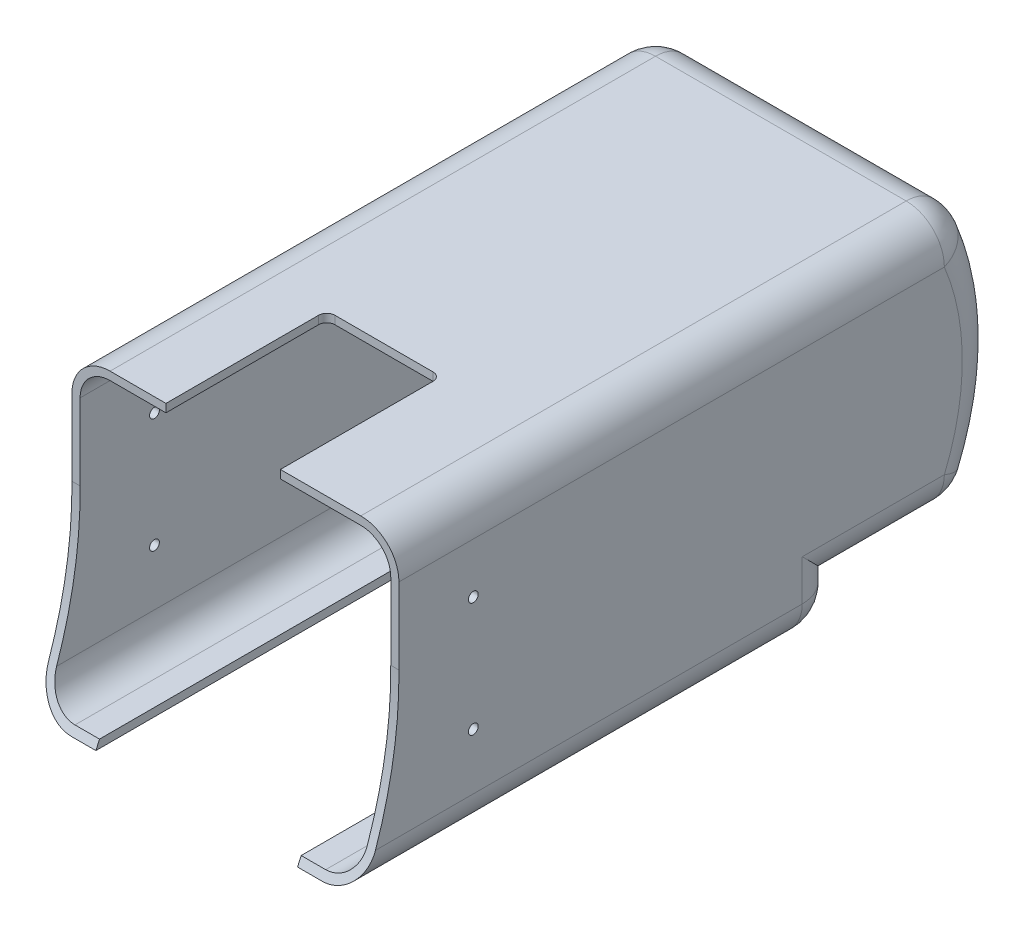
ISO-10303-21;
HEADER;
FILE_DESCRIPTION(('STEP AP214'),'2;1');
FILE_NAME('part.step','',(''),(''),'','','');
FILE_SCHEMA(('AUTOMOTIVE_DESIGN { 1 0 10303 214 1 1 1 1 }'));
ENDSEC;
DATA;
#1=APPLICATION_CONTEXT('core data for automotive mechanical design processes');
#2=APPLICATION_PROTOCOL_DEFINITION('international standard','automotive_design',2000,#1);
#3=PRODUCT_CONTEXT('',#1,'mechanical');
#4=PRODUCT('Part','Part','',(#3));
#5=PRODUCT_RELATED_PRODUCT_CATEGORY('part','',(#4));
#6=PRODUCT_DEFINITION_FORMATION('','',#4);
#7=PRODUCT_DEFINITION_CONTEXT('part definition',#1,'design');
#8=PRODUCT_DEFINITION('design','',#6,#7);
#9=PRODUCT_DEFINITION_SHAPE('','',#8);
#10=(LENGTH_UNIT() NAMED_UNIT(*) SI_UNIT(.MILLI.,.METRE.));
#11=(NAMED_UNIT(*) PLANE_ANGLE_UNIT() SI_UNIT($,.RADIAN.));
#12=(NAMED_UNIT(*) SI_UNIT($,.STERADIAN.) SOLID_ANGLE_UNIT());
#13=UNCERTAINTY_MEASURE_WITH_UNIT(LENGTH_MEASURE(1.E-05),#10,'distance_accuracy_value','');
#14=(GEOMETRIC_REPRESENTATION_CONTEXT(3) GLOBAL_UNCERTAINTY_ASSIGNED_CONTEXT((#13)) GLOBAL_UNIT_ASSIGNED_CONTEXT((#10,
#11,#12)) REPRESENTATION_CONTEXT('',''));
#15=CARTESIAN_POINT('',(0.,0.,0.));
#16=DIRECTION('',(0.,0.,1.));
#17=DIRECTION('',(1.,0.,0.));
#18=AXIS2_PLACEMENT_3D('',#15,#16,#17);
#19=CARTESIAN_POINT('',(-60.,-39.5,-146.));
#20=DIRECTION('',(0.,0.,1.));
#21=DIRECTION('',(1.,0.,0.));
#22=AXIS2_PLACEMENT_3D('',#19,#20,#21);
#23=PLANE('',#22);
#24=DIRECTION('',(1.,0.,0.));
#25=VECTOR('',#24,1.);
#26=CARTESIAN_POINT('',(-60.,-40.5,-146.));
#27=LINE('',#26,#25);
#28=CARTESIAN_POINT('',(46.,-40.5,-146.));
#29=VERTEX_POINT('',#28);
#30=CARTESIAN_POINT('',(37.,-40.5,-146.));
#31=VERTEX_POINT('',#30);
#32=EDGE_CURVE('E681',#29,#31,#27,.F.);
#33=ORIENTED_EDGE('',*,*,#32,.T.);
#34=DIRECTION('',(0.,-1.,0.));
#35=VECTOR('',#34,1.);
#36=CARTESIAN_POINT('',(37.,-39.5,-146.));
#37=LINE('',#36,#35);
#38=CARTESIAN_POINT('',(37.,-39.5,-146.));
#39=VERTEX_POINT('',#38);
#40=EDGE_CURVE('E683',#39,#31,#37,.T.);
#41=ORIENTED_EDGE('',*,*,#40,.F.);
#42=DIRECTION('',(1.,0.,0.));
#43=VECTOR('',#42,1.);
#44=CARTESIAN_POINT('',(-60.,-39.5,-146.));
#45=LINE('',#44,#43);
#46=CARTESIAN_POINT('',(46.,-39.5,-146.));
#47=VERTEX_POINT('',#46);
#48=EDGE_CURVE('E778',#39,#47,#45,.T.);
#49=ORIENTED_EDGE('',*,*,#48,.T.);
#50=DIRECTION('',(0.,-1.,0.));
#51=VECTOR('',#50,1.);
#52=CARTESIAN_POINT('',(46.,-54.5,-146.));
#53=LINE('',#52,#51);
#54=EDGE_CURVE('E686',#47,#29,#53,.T.);
#55=ORIENTED_EDGE('',*,*,#54,.T.);
#56=EDGE_LOOP('',(#33,#41,#49,#55));
#57=FACE_BOUND('',#56,.T.);
#58=ADVANCED_FACE('F39',(#57),#23,.F.);
#59=CARTESIAN_POINT('',(-60.,-40.5,-132.));
#60=DIRECTION('',(-1.,0.,0.));
#61=DIRECTION('',(0.,0.,1.));
#62=AXIS2_PLACEMENT_3D('',#59,#60,#61);
#63=CYLINDRICAL_SURFACE('',#62,14.);
#64=CARTESIAN_POINT('',(37.,-40.5,-132.));
#65=DIRECTION('',(1.,0.,0.));
#66=DIRECTION('',(0.,0.,-1.));
#67=AXIS2_PLACEMENT_3D('',#64,#65,#66);
#68=CIRCLE('',#67,14.);
#69=CARTESIAN_POINT('',(37.,-54.5,-132.));
#70=VERTEX_POINT('',#69);
#71=EDGE_CURVE('E870',#70,#31,#68,.T.);
#72=ORIENTED_EDGE('',*,*,#71,.T.);
#73=ORIENTED_EDGE('',*,*,#32,.F.);
#74=CARTESIAN_POINT('',(46.,-40.5,-132.));
#75=DIRECTION('',(1.,0.,0.));
#76=DIRECTION('',(0.,0.,-1.));
#77=AXIS2_PLACEMENT_3D('',#74,#75,#76);
#78=CIRCLE('',#77,14.);
#79=CARTESIAN_POINT('',(46.,-54.5,-132.));
#80=VERTEX_POINT('',#79);
#81=EDGE_CURVE('E775',#80,#29,#78,.T.);
#82=ORIENTED_EDGE('',*,*,#81,.F.);
#83=DIRECTION('',(1.,0.,0.));
#84=VECTOR('',#83,1.);
#85=CARTESIAN_POINT('',(60.,-54.5,-132.));
#86=LINE('',#85,#84);
#87=EDGE_CURVE('E1147',#70,#80,#86,.T.);
#88=ORIENTED_EDGE('',*,*,#87,.F.);
#89=EDGE_LOOP('',(#72,#73,#82,#88));
#90=FACE_BOUND('',#89,.T.);
#91=ADVANCED_FACE('F476',(#90),#63,.T.);
#92=CARTESIAN_POINT('',(-60.,-54.5,-193.));
#93=DIRECTION('',(0.,-1.,0.));
#94=DIRECTION('',(0.,0.,-1.));
#95=AXIS2_PLACEMENT_3D('',#92,#93,#94);
#96=PLANE('',#95);
#97=DIRECTION('',(1.,0.,0.));
#98=VECTOR('',#97,1.);
#99=CARTESIAN_POINT('',(-60.,-54.5,30.2163082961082));
#100=LINE('',#99,#98);
#101=CARTESIAN_POINT('',(37.,-54.5,30.2163082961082));
#102=VERTEX_POINT('',#101);
#103=CARTESIAN_POINT('',(46.,-54.5,30.2163082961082));
#104=VERTEX_POINT('',#103);
#105=EDGE_CURVE('E365',#102,#104,#100,.T.);
#106=ORIENTED_EDGE('',*,*,#105,.F.);
#107=DIRECTION('',(0.,0.,1.));
#108=VECTOR('',#107,1.);
#109=CARTESIAN_POINT('',(37.,-54.5,32.4169854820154));
#110=LINE('',#109,#108);
#111=EDGE_CURVE('E897',#70,#102,#110,.T.);
#112=ORIENTED_EDGE('',*,*,#111,.F.);
#113=ORIENTED_EDGE('',*,*,#87,.T.);
#114=DIRECTION('',(0.,0.,1.));
#115=VECTOR('',#114,1.);
#116=CARTESIAN_POINT('',(46.,-54.5,-193.));
#117=LINE('',#116,#115);
#118=EDGE_CURVE('E1151',#80,#104,#117,.T.);
#119=ORIENTED_EDGE('',*,*,#118,.T.);
#120=EDGE_LOOP('',(#106,#112,#113,#119));
#121=FACE_BOUND('',#120,.T.);
#122=ADVANCED_FACE('F554',(#121),#96,.T.);
#123=CARTESIAN_POINT('',(-60.,-51.5,-193.));
#124=DIRECTION('',(0.,-1.,0.));
#125=DIRECTION('',(0.,0.,-1.));
#126=AXIS2_PLACEMENT_3D('',#123,#124,#125);
#127=PLANE('',#126);
#128=DIRECTION('',(0.,0.,-1.));
#129=VECTOR('',#128,1.);
#130=CARTESIAN_POINT('',(37.,-51.5,32.4169854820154));
#131=LINE('',#130,#129);
#132=CARTESIAN_POINT('',(37.,-51.5,28.8871129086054));
#133=VERTEX_POINT('',#132);
#134=CARTESIAN_POINT('',(37.,-51.5,-132.));
#135=VERTEX_POINT('',#134);
#136=EDGE_CURVE('E906',#133,#135,#131,.T.);
#137=ORIENTED_EDGE('',*,*,#136,.F.);
#138=DIRECTION('',(1.,0.,0.));
#139=VECTOR('',#138,1.);
#140=CARTESIAN_POINT('',(-60.,-51.5,28.8871129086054));
#141=LINE('',#140,#139);
#142=CARTESIAN_POINT('',(46.,-51.5,28.8871129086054));
#143=VERTEX_POINT('',#142);
#144=EDGE_CURVE('E1221',#133,#143,#141,.T.);
#145=ORIENTED_EDGE('',*,*,#144,.T.);
#146=DIRECTION('',(0.,0.,-1.));
#147=VECTOR('',#146,1.);
#148=CARTESIAN_POINT('',(46.,-51.5,-193.));
#149=LINE('',#148,#147);
#150=CARTESIAN_POINT('',(46.,-51.5,-132.));
#151=VERTEX_POINT('',#150);
#152=EDGE_CURVE('E946',#151,#143,#149,.F.);
#153=ORIENTED_EDGE('',*,*,#152,.F.);
#154=DIRECTION('',(1.,0.,0.));
#155=VECTOR('',#154,1.);
#156=CARTESIAN_POINT('',(-60.,-51.5,-132.));
#157=LINE('',#156,#155);
#158=EDGE_CURVE('E963',#135,#151,#157,.T.);
#159=ORIENTED_EDGE('',*,*,#158,.F.);
#160=EDGE_LOOP('',(#137,#145,#153,#159));
#161=FACE_BOUND('',#160,.T.);
#162=ADVANCED_FACE('F655',(#161),#127,.F.);
#163=CARTESIAN_POINT('',(-60.,-39.5,-143.));
#164=DIRECTION('',(0.,0.,1.));
#165=DIRECTION('',(1.,0.,0.));
#166=AXIS2_PLACEMENT_3D('',#163,#164,#165);
#167=PLANE('',#166);
#168=DIRECTION('',(0.,-1.,0.));
#169=VECTOR('',#168,1.);
#170=CARTESIAN_POINT('',(37.,54.501,-143.));
#171=LINE('',#170,#169);
#172=CARTESIAN_POINT('',(37.,-36.5,-143.));
#173=VERTEX_POINT('',#172);
#174=CARTESIAN_POINT('',(37.,-40.5,-143.));
#175=VERTEX_POINT('',#174);
#176=EDGE_CURVE('E903',#173,#175,#171,.T.);
#177=ORIENTED_EDGE('',*,*,#176,.T.);
#178=DIRECTION('',(1.,0.,0.));
#179=VECTOR('',#178,1.);
#180=CARTESIAN_POINT('',(-60.,-40.5,-143.));
#181=LINE('',#180,#179);
#182=CARTESIAN_POINT('',(46.,-40.5,-143.));
#183=VERTEX_POINT('',#182);
#184=EDGE_CURVE('E993',#183,#175,#181,.F.);
#185=ORIENTED_EDGE('',*,*,#184,.F.);
#186=DIRECTION('',(0.,1.,0.));
#187=VECTOR('',#186,1.);
#188=CARTESIAN_POINT('',(46.,-39.5,-143.));
#189=LINE('',#188,#187);
#190=CARTESIAN_POINT('',(46.,-36.5,-143.));
#191=VERTEX_POINT('',#190);
#192=EDGE_CURVE('E959',#191,#183,#189,.F.);
#193=ORIENTED_EDGE('',*,*,#192,.F.);
#194=DIRECTION('',(1.,0.,0.));
#195=VECTOR('',#194,1.);
#196=CARTESIAN_POINT('',(-60.,-36.5,-143.));
#197=LINE('',#196,#195);
#198=EDGE_CURVE('E1003',#173,#191,#197,.T.);
#199=ORIENTED_EDGE('',*,*,#198,.F.);
#200=EDGE_LOOP('',(#177,#185,#193,#199));
#201=FACE_BOUND('',#200,.T.);
#202=ADVANCED_FACE('F646',(#201),#167,.T.);
#203=CARTESIAN_POINT('',(-60.,-40.5,-132.));
#204=DIRECTION('',(-1.,0.,0.));
#205=DIRECTION('',(0.,0.,1.));
#206=AXIS2_PLACEMENT_3D('',#203,#204,#205);
#207=CYLINDRICAL_SURFACE('',#206,11.);
#208=ORIENTED_EDGE('',*,*,#184,.T.);
#209=CARTESIAN_POINT('',(37.,-40.5,-132.));
#210=DIRECTION('',(1.,0.,0.));
#211=DIRECTION('',(0.,0.,-1.));
#212=AXIS2_PLACEMENT_3D('',#209,#210,#211);
#213=CIRCLE('',#212,11.);
#214=EDGE_CURVE('E900',#135,#175,#213,.T.);
#215=ORIENTED_EDGE('',*,*,#214,.F.);
#216=ORIENTED_EDGE('',*,*,#158,.T.);
#217=CARTESIAN_POINT('',(46.,-40.5,-132.));
#218=DIRECTION('',(-1.,0.,0.));
#219=DIRECTION('',(0.,-1.,0.));
#220=AXIS2_PLACEMENT_3D('',#217,#218,#219);
#221=CIRCLE('',#220,11.);
#222=EDGE_CURVE('E955',#151,#183,#221,.F.);
#223=ORIENTED_EDGE('',*,*,#222,.T.);
#224=EDGE_LOOP('',(#208,#215,#216,#223));
#225=FACE_BOUND('',#224,.T.);
#226=ADVANCED_FACE('F545',(#225),#207,.F.);
#227=CARTESIAN_POINT('',(60.,54.5,-193.));
#228=DIRECTION('',(0.,1.,0.));
#229=DIRECTION('',(0.,0.,1.));
#230=AXIS2_PLACEMENT_3D('',#227,#228,#229);
#231=PLANE('',#230);
#232=DIRECTION('',(1.,0.,0.));
#233=VECTOR('',#232,1.);
#234=CARTESIAN_POINT('',(-60.,54.5,16.0072110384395));
#235=LINE('',#234,#233);
#236=CARTESIAN_POINT('',(16.5,54.5,16.0072110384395));
#237=VERTEX_POINT('',#236);
#238=CARTESIAN_POINT('',(46.,54.5,16.0072110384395));
#239=VERTEX_POINT('',#238);
#240=EDGE_CURVE('E56',#237,#239,#235,.T.);
#241=ORIENTED_EDGE('',*,*,#240,.T.);
#242=DIRECTION('',(0.,0.,1.));
#243=VECTOR('',#242,1.);
#244=CARTESIAN_POINT('',(46.,54.5,-193.));
#245=LINE('',#244,#243);
#246=CARTESIAN_POINT('',(46.,54.5,-184.149981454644));
#247=VERTEX_POINT('',#246);
#248=EDGE_CURVE('E1082',#239,#247,#245,.F.);
#249=ORIENTED_EDGE('',*,*,#248,.T.);
#250=DIRECTION('',(1.,0.,0.));
#251=VECTOR('',#250,1.);
#252=CARTESIAN_POINT('',(60.,54.5,-184.149981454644));
#253=LINE('',#252,#251);
#254=CARTESIAN_POINT('',(-46.,54.5,-184.149981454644));
#255=VERTEX_POINT('',#254);
#256=EDGE_CURVE('E1085',#247,#255,#253,.F.);
#257=ORIENTED_EDGE('',*,*,#256,.T.);
#258=DIRECTION('',(0.,0.,1.));
#259=VECTOR('',#258,1.);
#260=CARTESIAN_POINT('',(-46.,54.5,-193.));
#261=LINE('',#260,#259);
#262=CARTESIAN_POINT('',(-46.,54.5,16.0072110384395));
#263=VERTEX_POINT('',#262);
#264=EDGE_CURVE('E1089',#255,#263,#261,.T.);
#265=ORIENTED_EDGE('',*,*,#264,.T.);
#266=CARTESIAN_POINT('',(-25.5,54.5,16.0072110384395));
#267=VERTEX_POINT('',#266);
#268=EDGE_CURVE('E385',#263,#267,#235,.T.);
#269=ORIENTED_EDGE('',*,*,#268,.T.);
#270=DIRECTION('',(0.,0.,1.));
#271=VECTOR('',#270,1.);
#272=CARTESIAN_POINT('',(-25.5,54.5,24.1876173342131));
#273=LINE('',#272,#271);
#274=CARTESIAN_POINT('',(-25.5,54.5,-40.));
#275=VERTEX_POINT('',#274);
#276=EDGE_CURVE('E815',#275,#267,#273,.T.);
#277=ORIENTED_EDGE('',*,*,#276,.F.);
#278=CARTESIAN_POINT('',(-22.5,54.5,-40.));
#279=DIRECTION('',(0.,1.,0.));
#280=DIRECTION('',(0.,0.,-1.));
#281=AXIS2_PLACEMENT_3D('',#278,#279,#280);
#282=CIRCLE('',#281,3.);
#283=CARTESIAN_POINT('',(-22.5,54.5,-43.));
#284=VERTEX_POINT('',#283);
#285=EDGE_CURVE('E828',#284,#275,#282,.T.);
#286=ORIENTED_EDGE('',*,*,#285,.F.);
#287=DIRECTION('',(-1.,0.,0.));
#288=VECTOR('',#287,1.);
#289=CARTESIAN_POINT('',(-22.5,54.5,-43.));
#290=LINE('',#289,#288);
#291=CARTESIAN_POINT('',(13.5,54.5,-43.));
#292=VERTEX_POINT('',#291);
#293=EDGE_CURVE('E1160',#292,#284,#290,.T.);
#294=ORIENTED_EDGE('',*,*,#293,.F.);
#295=CARTESIAN_POINT('',(13.5,54.5,-40.));
#296=DIRECTION('',(0.,1.,0.));
#297=DIRECTION('',(0.,0.,-1.));
#298=AXIS2_PLACEMENT_3D('',#295,#296,#297);
#299=CIRCLE('',#298,3.);
#300=CARTESIAN_POINT('',(16.5,54.5,-40.));
#301=VERTEX_POINT('',#300);
#302=EDGE_CURVE('E1162',#301,#292,#299,.T.);
#303=ORIENTED_EDGE('',*,*,#302,.F.);
#304=DIRECTION('',(0.,0.,-1.));
#305=VECTOR('',#304,1.);
#306=CARTESIAN_POINT('',(16.5,54.5,-40.));
#307=LINE('',#306,#305);
#308=EDGE_CURVE('E844',#237,#301,#307,.T.);
#309=ORIENTED_EDGE('',*,*,#308,.F.);
#310=EDGE_LOOP('',(#241,#249,#257,#265,#269,#277,#286,#294,#303,#309));
#311=FACE_BOUND('',#310,.T.);
#312=ADVANCED_FACE('F541',(#311),#231,.T.);
#313=CARTESIAN_POINT('',(60.,-54.5,-193.));
#314=DIRECTION('',(1.,0.,0.));
#315=DIRECTION('',(0.,0.,-1.));
#316=AXIS2_PLACEMENT_3D('',#313,#314,#315);
#317=PLANE('',#316);
#318=DIRECTION('',(0.,1.,0.));
#319=VECTOR('',#318,1.);
#320=CARTESIAN_POINT('',(60.,54.5,16.0072110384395));
#321=LINE('',#320,#319);
#322=CARTESIAN_POINT('',(60.,12.509515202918,16.0072110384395));
#323=VERTEX_POINT('',#322);
#324=CARTESIAN_POINT('',(60.,40.5,16.0072110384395));
#325=VERTEX_POINT('',#324);
#326=EDGE_CURVE('E373',#323,#325,#321,.T.);
#327=ORIENTED_EDGE('',*,*,#326,.F.);
#328=CARTESIAN_POINT('',(60.,11.0000000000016,174.));
#329=DIRECTION('',(1.,0.,0.));
#330=DIRECTION('',(0.,0.,-1.));
#331=AXIS2_PLACEMENT_3D('',#328,#329,#330);
#332=CIRCLE('',#331,158.);
#333=CARTESIAN_POINT('',(60.,-40.5,24.628818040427));
#334=VERTEX_POINT('',#333);
#335=EDGE_CURVE('E378',#334,#323,#332,.T.);
#336=ORIENTED_EDGE('',*,*,#335,.F.);
#337=DIRECTION('',(0.,0.,1.));
#338=VECTOR('',#337,1.);
#339=CARTESIAN_POINT('',(60.,-40.5,-193.));
#340=LINE('',#339,#338);
#341=CARTESIAN_POINT('',(60.,-40.5,-132.));
#342=VERTEX_POINT('',#341);
#343=EDGE_CURVE('E1133',#334,#342,#340,.F.);
#344=ORIENTED_EDGE('',*,*,#343,.T.);
#345=DIRECTION('',(0.,-1.,0.));
#346=VECTOR('',#345,1.);
#347=CARTESIAN_POINT('',(60.,-39.5,-132.));
#348=LINE('',#347,#346);
#349=CARTESIAN_POINT('',(60.,-25.5,-132.));
#350=VERTEX_POINT('',#349);
#351=EDGE_CURVE('E1130',#342,#350,#348,.F.);
#352=ORIENTED_EDGE('',*,*,#351,.T.);
#353=DIRECTION('',(0.,0.,1.));
#354=VECTOR('',#353,1.);
#355=CARTESIAN_POINT('',(60.,-25.5,-193.));
#356=LINE('',#355,#354);
#357=CARTESIAN_POINT('',(60.,-25.5,-184.149981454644));
#358=VERTEX_POINT('',#357);
#359=EDGE_CURVE('E1127',#350,#358,#356,.F.);
#360=ORIENTED_EDGE('',*,*,#359,.T.);
#361=CARTESIAN_POINT('',(60.,7.5,-104.733358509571));
#362=DIRECTION('',(1.,0.,0.));
#363=DIRECTION('',(0.,0.,-1.));
#364=AXIS2_PLACEMENT_3D('',#361,#362,#363);
#365=CIRCLE('',#364,86.);
#366=CARTESIAN_POINT('',(60.,40.5,-184.149981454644));
#367=VERTEX_POINT('',#366);
#368=EDGE_CURVE('E1124',#358,#367,#365,.T.);
#369=ORIENTED_EDGE('',*,*,#368,.T.);
#370=DIRECTION('',(0.,0.,1.));
#371=VECTOR('',#370,1.);
#372=CARTESIAN_POINT('',(60.,40.5,-193.));
#373=LINE('',#372,#371);
#374=EDGE_CURVE('E1120',#367,#325,#373,.T.);
#375=ORIENTED_EDGE('',*,*,#374,.T.);
#376=EDGE_LOOP('',(#327,#336,#344,#352,#360,#369,#375));
#377=FACE_BOUND('',#376,.T.);
#378=CARTESIAN_POINT('',(60.,22.072,-11.2860000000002));
#379=DIRECTION('',(-1.,0.,0.));
#380=DIRECTION('',(0.,0.,1.));
#381=AXIS2_PLACEMENT_3D('',#378,#379,#380);
#382=CIRCLE('',#381,1.79999999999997);
#383=CARTESIAN_POINT('',(60.,22.072,-9.48600000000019));
#384=VERTEX_POINT('',#383);
#385=EDGE_CURVE('E807',#384,#384,#382,.T.);
#386=ORIENTED_EDGE('',*,*,#385,.T.);
#387=EDGE_LOOP('',(#386));
#388=FACE_BOUND('',#387,.T.);
#389=CARTESIAN_POINT('',(60.,-19.928,-11.2860000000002));
#390=DIRECTION('',(-1.,0.,0.));
#391=DIRECTION('',(0.,0.,1.));
#392=AXIS2_PLACEMENT_3D('',#389,#390,#391);
#393=CIRCLE('',#392,1.79999999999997);
#394=CARTESIAN_POINT('',(60.,-19.928,-9.48600000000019));
#395=VERTEX_POINT('',#394);
#396=EDGE_CURVE('E802',#395,#395,#393,.T.);
#397=ORIENTED_EDGE('',*,*,#396,.T.);
#398=EDGE_LOOP('',(#397));
#399=FACE_BOUND('',#398,.T.);
#400=ADVANCED_FACE('F544',(#377,#388,#399),#317,.T.);
#401=CARTESIAN_POINT('',(-46.,-54.5,30.2163082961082));
#402=VERTEX_POINT('',#401);
#403=CARTESIAN_POINT('',(-37.,-54.5,30.2163082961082));
#404=VERTEX_POINT('',#403);
#405=EDGE_CURVE('E389',#402,#404,#100,.T.);
#406=ORIENTED_EDGE('',*,*,#405,.F.);
#407=DIRECTION('',(0.,0.,1.));
#408=VECTOR('',#407,1.);
#409=CARTESIAN_POINT('',(-46.,-54.5,-193.));
#410=LINE('',#409,#408);
#411=CARTESIAN_POINT('',(-46.,-54.5,-132.));
#412=VERTEX_POINT('',#411);
#413=EDGE_CURVE('E1154',#402,#412,#410,.F.);
#414=ORIENTED_EDGE('',*,*,#413,.T.);
#415=CARTESIAN_POINT('',(-37.,-54.5,-132.));
#416=VERTEX_POINT('',#415);
#417=EDGE_CURVE('E1148',#412,#416,#86,.T.);
#418=ORIENTED_EDGE('',*,*,#417,.T.);
#419=DIRECTION('',(0.,0.,-1.));
#420=VECTOR('',#419,1.);
#421=CARTESIAN_POINT('',(-37.,-54.5,32.4169854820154));
#422=LINE('',#421,#420);
#423=EDGE_CURVE('E894',#404,#416,#422,.T.);
#424=ORIENTED_EDGE('',*,*,#423,.F.);
#425=EDGE_LOOP('',(#406,#414,#418,#424));
#426=FACE_BOUND('',#425,.T.);
#427=ADVANCED_FACE('F550',(#426),#96,.T.);
#428=CARTESIAN_POINT('',(-60.,54.5,-193.));
#429=DIRECTION('',(-1.,0.,0.));
#430=DIRECTION('',(0.,0.,1.));
#431=AXIS2_PLACEMENT_3D('',#428,#429,#430);
#432=PLANE('',#431);
#433=DIRECTION('',(0.,1.,0.));
#434=VECTOR('',#433,1.);
#435=CARTESIAN_POINT('',(-60.,12.509515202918,16.0072110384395));
#436=LINE('',#435,#434);
#437=CARTESIAN_POINT('',(-60.,12.509515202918,16.0072110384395));
#438=VERTEX_POINT('',#437);
#439=CARTESIAN_POINT('',(-60.,40.5,16.0072110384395));
#440=VERTEX_POINT('',#439);
#441=EDGE_CURVE('E358',#438,#440,#436,.T.);
#442=ORIENTED_EDGE('',*,*,#441,.T.);
#443=DIRECTION('',(0.,0.,1.));
#444=VECTOR('',#443,1.);
#445=CARTESIAN_POINT('',(-60.,40.5,-193.));
#446=LINE('',#445,#444);
#447=CARTESIAN_POINT('',(-60.,40.5,-184.149981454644));
#448=VERTEX_POINT('',#447);
#449=EDGE_CURVE('E1106',#440,#448,#446,.F.);
#450=ORIENTED_EDGE('',*,*,#449,.T.);
#451=CARTESIAN_POINT('',(-60.,7.5,-104.733358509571));
#452=DIRECTION('',(-1.,0.,0.));
#453=DIRECTION('',(0.,0.,1.));
#454=AXIS2_PLACEMENT_3D('',#451,#452,#453);
#455=CIRCLE('',#454,86.);
#456=CARTESIAN_POINT('',(-60.,-25.5,-184.149981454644));
#457=VERTEX_POINT('',#456);
#458=EDGE_CURVE('E1109',#448,#457,#455,.T.);
#459=ORIENTED_EDGE('',*,*,#458,.T.);
#460=DIRECTION('',(0.,0.,1.));
#461=VECTOR('',#460,1.);
#462=CARTESIAN_POINT('',(-60.,-25.5,-146.));
#463=LINE('',#462,#461);
#464=CARTESIAN_POINT('',(-60.,-25.5,-132.));
#465=VERTEX_POINT('',#464);
#466=EDGE_CURVE('E1112',#457,#465,#463,.T.);
#467=ORIENTED_EDGE('',*,*,#466,.T.);
#468=DIRECTION('',(0.,-1.,0.));
#469=VECTOR('',#468,1.);
#470=CARTESIAN_POINT('',(-60.,-54.5,-132.));
#471=LINE('',#470,#469);
#472=CARTESIAN_POINT('',(-60.,-40.5,-132.));
#473=VERTEX_POINT('',#472);
#474=EDGE_CURVE('E1115',#465,#473,#471,.T.);
#475=ORIENTED_EDGE('',*,*,#474,.T.);
#476=DIRECTION('',(0.,0.,1.));
#477=VECTOR('',#476,1.);
#478=CARTESIAN_POINT('',(-60.,-40.5,-193.));
#479=LINE('',#478,#477);
#480=CARTESIAN_POINT('',(-60.,-40.5,24.628818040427));
#481=VERTEX_POINT('',#480);
#482=EDGE_CURVE('E371',#473,#481,#479,.T.);
#483=ORIENTED_EDGE('',*,*,#482,.T.);
#484=CARTESIAN_POINT('',(-60.,11.0000000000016,174.));
#485=DIRECTION('',(1.,0.,0.));
#486=DIRECTION('',(0.,0.,-1.));
#487=AXIS2_PLACEMENT_3D('',#484,#485,#486);
#488=CIRCLE('',#487,158.);
#489=EDGE_CURVE('E349',#481,#438,#488,.T.);
#490=ORIENTED_EDGE('',*,*,#489,.T.);
#491=EDGE_LOOP('',(#442,#450,#459,#467,#475,#483,#490));
#492=FACE_BOUND('',#491,.T.);
#493=CARTESIAN_POINT('',(-60.,22.072,-11.2860000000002));
#494=DIRECTION('',(-1.,0.,0.));
#495=DIRECTION('',(0.,0.,1.));
#496=AXIS2_PLACEMENT_3D('',#493,#494,#495);
#497=CIRCLE('',#496,1.79999999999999);
#498=CARTESIAN_POINT('',(-60.,22.072,-9.48600000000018));
#499=VERTEX_POINT('',#498);
#500=EDGE_CURVE('E1214',#499,#499,#497,.T.);
#501=ORIENTED_EDGE('',*,*,#500,.F.);
#502=EDGE_LOOP('',(#501));
#503=FACE_BOUND('',#502,.T.);
#504=CARTESIAN_POINT('',(-60.,-19.928,-11.2860000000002));
#505=DIRECTION('',(-1.,0.,0.));
#506=DIRECTION('',(0.,0.,1.));
#507=AXIS2_PLACEMENT_3D('',#504,#505,#506);
#508=CIRCLE('',#507,1.79999999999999);
#509=CARTESIAN_POINT('',(-60.,-19.928,-9.48600000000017));
#510=VERTEX_POINT('',#509);
#511=EDGE_CURVE('E1205',#510,#510,#508,.T.);
#512=ORIENTED_EDGE('',*,*,#511,.F.);
#513=EDGE_LOOP('',(#512));
#514=FACE_BOUND('',#513,.T.);
#515=ADVANCED_FACE('F368',(#492,#503,#514),#432,.T.);
#516=CARTESIAN_POINT('',(-46.,-39.5,-146.));
#517=VERTEX_POINT('',#516);
#518=CARTESIAN_POINT('',(-37.,-39.5,-146.));
#519=VERTEX_POINT('',#518);
#520=EDGE_CURVE('E1078',#517,#519,#45,.T.);
#521=ORIENTED_EDGE('',*,*,#520,.T.);
#522=DIRECTION('',(0.,1.,0.));
#523=VECTOR('',#522,1.);
#524=CARTESIAN_POINT('',(-37.,-47.711102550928,-146.));
#525=LINE('',#524,#523);
#526=CARTESIAN_POINT('',(-37.,-40.5,-146.));
#527=VERTEX_POINT('',#526);
#528=EDGE_CURVE('E866',#527,#519,#525,.T.);
#529=ORIENTED_EDGE('',*,*,#528,.F.);
#530=CARTESIAN_POINT('',(-46.,-40.5,-146.));
#531=VERTEX_POINT('',#530);
#532=EDGE_CURVE('E691',#527,#531,#27,.F.);
#533=ORIENTED_EDGE('',*,*,#532,.T.);
#534=DIRECTION('',(0.,-1.,0.));
#535=VECTOR('',#534,1.);
#536=CARTESIAN_POINT('',(-46.,-39.5,-146.));
#537=LINE('',#536,#535);
#538=EDGE_CURVE('E690',#531,#517,#537,.F.);
#539=ORIENTED_EDGE('',*,*,#538,.T.);
#540=EDGE_LOOP('',(#521,#529,#533,#539));
#541=FACE_BOUND('',#540,.T.);
#542=ADVANCED_FACE('F549',(#541),#23,.F.);
#543=CARTESIAN_POINT('',(-60.,-39.5,-193.));
#544=DIRECTION('',(0.,1.,0.));
#545=DIRECTION('',(0.,0.,1.));
#546=AXIS2_PLACEMENT_3D('',#543,#544,#545);
#547=PLANE('',#546);
#548=DIRECTION('',(1.,0.,0.));
#549=VECTOR('',#548,1.);
#550=CARTESIAN_POINT('',(-37.,-39.5,-147.954451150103));
#551=LINE('',#550,#549);
#552=CARTESIAN_POINT('',(-37.,-39.5,-147.954451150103));
#553=VERTEX_POINT('',#552);
#554=CARTESIAN_POINT('',(37.,-39.5,-147.954451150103));
#555=VERTEX_POINT('',#554);
#556=EDGE_CURVE('E853',#553,#555,#551,.T.);
#557=ORIENTED_EDGE('',*,*,#556,.F.);
#558=DIRECTION('',(0.,0.,-1.));
#559=VECTOR('',#558,1.);
#560=CARTESIAN_POINT('',(-37.,-39.5,-142.954451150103));
#561=LINE('',#560,#559);
#562=EDGE_CURVE('E835',#519,#553,#561,.T.);
#563=ORIENTED_EDGE('',*,*,#562,.F.);
#564=ORIENTED_EDGE('',*,*,#520,.F.);
#565=DIRECTION('',(0.,0.,1.));
#566=VECTOR('',#565,1.);
#567=CARTESIAN_POINT('',(-46.,-39.5,-193.));
#568=LINE('',#567,#566);
#569=CARTESIAN_POINT('',(-46.,-39.5,-184.149981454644));
#570=VERTEX_POINT('',#569);
#571=EDGE_CURVE('E1136',#517,#570,#568,.F.);
#572=ORIENTED_EDGE('',*,*,#571,.T.);
#573=DIRECTION('',(-1.,0.,0.));
#574=VECTOR('',#573,1.);
#575=CARTESIAN_POINT('',(60.,-39.5,-184.149981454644));
#576=LINE('',#575,#574);
#577=CARTESIAN_POINT('',(46.,-39.5,-184.149981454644));
#578=VERTEX_POINT('',#577);
#579=EDGE_CURVE('E1139',#570,#578,#576,.F.);
#580=ORIENTED_EDGE('',*,*,#579,.T.);
#581=DIRECTION('',(0.,0.,1.));
#582=VECTOR('',#581,1.);
#583=CARTESIAN_POINT('',(46.,-39.5,-146.));
#584=LINE('',#583,#582);
#585=EDGE_CURVE('E1143',#578,#47,#584,.T.);
#586=ORIENTED_EDGE('',*,*,#585,.T.);
#587=ORIENTED_EDGE('',*,*,#48,.F.);
#588=DIRECTION('',(0.,0.,1.));
#589=VECTOR('',#588,1.);
#590=CARTESIAN_POINT('',(37.,-39.5,-142.954451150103));
#591=LINE('',#590,#589);
#592=EDGE_CURVE('E850',#555,#39,#591,.T.);
#593=ORIENTED_EDGE('',*,*,#592,.F.);
#594=EDGE_LOOP('',(#557,#563,#564,#572,#580,#586,#587,#593));
#595=FACE_BOUND('',#594,.T.);
#596=ADVANCED_FACE('F558',(#595),#547,.F.);
#597=CARTESIAN_POINT('',(-154.729465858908,7.5,-104.733358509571));
#598=DIRECTION('',(1.,0.,0.));
#599=DIRECTION('',(0.,0.,-1.));
#600=AXIS2_PLACEMENT_3D('',#597,#598,#599);
#601=CYLINDRICAL_SURFACE('',#600,100.);
#602=CARTESIAN_POINT('',(-46.,7.5,-104.733358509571));
#603=DIRECTION('',(-1.,0.,0.));
#604=DIRECTION('',(0.,0.,1.));
#605=AXIS2_PLACEMENT_3D('',#602,#603,#604);
#606=CIRCLE('',#605,100.);
#607=CARTESIAN_POINT('',(-46.,-30.8720930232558,-197.078268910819));
#608=VERTEX_POINT('',#607);
#609=CARTESIAN_POINT('',(-46.,45.8720930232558,-197.078268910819));
#610=VERTEX_POINT('',#609);
#611=EDGE_CURVE('E1099',#608,#610,#606,.F.);
#612=ORIENTED_EDGE('',*,*,#611,.T.);
#613=DIRECTION('',(1.,0.,0.));
#614=VECTOR('',#613,1.);
#615=CARTESIAN_POINT('',(-154.729465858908,45.8720930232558,-197.078268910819));
#616=LINE('',#615,#614);
#617=CARTESIAN_POINT('',(46.,45.8720930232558,-197.078268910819));
#618=VERTEX_POINT('',#617);
#619=EDGE_CURVE('E1102',#610,#618,#616,.T.);
#620=ORIENTED_EDGE('',*,*,#619,.T.);
#621=CARTESIAN_POINT('',(46.,7.5,-104.733358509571));
#622=DIRECTION('',(1.,0.,0.));
#623=DIRECTION('',(0.,0.,-1.));
#624=AXIS2_PLACEMENT_3D('',#621,#622,#623);
#625=CIRCLE('',#624,100.);
#626=CARTESIAN_POINT('',(46.,-30.8720930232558,-197.078268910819));
#627=VERTEX_POINT('',#626);
#628=EDGE_CURVE('E1096',#618,#627,#625,.F.);
#629=ORIENTED_EDGE('',*,*,#628,.T.);
#630=DIRECTION('',(1.,0.,0.));
#631=VECTOR('',#630,1.);
#632=CARTESIAN_POINT('',(-154.729465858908,-30.8720930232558,-197.078268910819));
#633=LINE('',#632,#631);
#634=EDGE_CURVE('E1093',#627,#608,#633,.F.);
#635=ORIENTED_EDGE('',*,*,#634,.T.);
#636=EDGE_LOOP('',(#612,#620,#629,#635));
#637=FACE_BOUND('',#636,.T.);
#638=ADVANCED_FACE('F561',(#637),#601,.T.);
#639=CARTESIAN_POINT('',(46.,-40.5,-193.));
#640=DIRECTION('',(0.,0.,1.));
#641=DIRECTION('',(1.,0.,0.));
#642=AXIS2_PLACEMENT_3D('',#639,#640,#641);
#643=CYLINDRICAL_SURFACE('',#642,14.);
#644=CARTESIAN_POINT('',(46.,-54.5,30.2163082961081));
#645=CARTESIAN_POINT('',(46.1849804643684,-54.5000007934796,30.2163091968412));
#646=CARTESIAN_POINT('',(46.3699368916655,-54.4963330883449,30.2146377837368));
#647=CARTESIAN_POINT('',(46.7394929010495,-54.4816790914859,30.2079633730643));
#648=CARTESIAN_POINT('',(46.9240924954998,-54.4706930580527,30.2029604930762));
#649=CARTESIAN_POINT('',(47.4767317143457,-54.4267990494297,30.182980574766));
#650=CARTESIAN_POINT('',(47.8437938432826,-54.3829551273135,30.1630322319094));
#651=CARTESIAN_POINT('',(48.5710911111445,-54.2667969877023,30.1102879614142));
#652=CARTESIAN_POINT('',(48.9313453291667,-54.1945808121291,30.0775362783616));
#653=CARTESIAN_POINT('',(49.6438298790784,-54.02245559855,29.9996903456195));
#654=CARTESIAN_POINT('',(49.9960599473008,-53.9225456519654,29.9545956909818));
#655=CARTESIAN_POINT('',(50.6898522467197,-53.696149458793,29.8527710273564));
#656=CARTESIAN_POINT('',(51.031421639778,-53.5696815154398,29.7960490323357));
#657=CARTESIAN_POINT('',(51.7020200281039,-53.2913553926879,29.6717462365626));
#658=CARTESIAN_POINT('',(52.0310481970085,-53.1394955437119,29.6041647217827));
#659=CARTESIAN_POINT('',(52.6747875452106,-52.8116915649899,29.4590018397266));
#660=CARTESIAN_POINT('',(52.9894911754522,-52.6357349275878,29.3814152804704));
#661=CARTESIAN_POINT('',(53.6027118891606,-52.2612860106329,29.2172266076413));
#662=CARTESIAN_POINT('',(53.901228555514,-52.0627931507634,29.130624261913));
#663=CARTESIAN_POINT('',(54.4926087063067,-51.6361565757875,28.9456372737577));
#664=CARTESIAN_POINT('',(54.7847253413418,-51.4071250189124,28.8469131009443));
#665=CARTESIAN_POINT('',(55.348450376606,-50.928008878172,28.6418573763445));
#666=CARTESIAN_POINT('',(55.6200516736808,-50.6779170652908,28.5355232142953));
#667=CARTESIAN_POINT('',(56.1413731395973,-50.1585667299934,28.3164074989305));
#668=CARTESIAN_POINT('',(56.3910956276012,-49.8893102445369,28.2036266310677));
#669=CARTESIAN_POINT('',(56.8677234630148,-49.333274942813,27.9726511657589));
#670=CARTESIAN_POINT('',(57.0946184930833,-49.0464882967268,27.8544541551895));
#671=CARTESIAN_POINT('',(57.5423687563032,-48.4328236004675,27.6037629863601));
#672=CARTESIAN_POINT('',(57.7611637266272,-48.1045929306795,27.4708959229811));
#673=CARTESIAN_POINT('',(58.1696406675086,-47.4321398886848,27.2014435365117));
#674=CARTESIAN_POINT('',(58.3593328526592,-47.0879231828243,27.0648595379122));
#675=CARTESIAN_POINT('',(58.7088708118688,-46.385455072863,26.7890901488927));
#676=CARTESIAN_POINT('',(58.868703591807,-46.0271976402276,26.6499036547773));
#677=CARTESIAN_POINT('',(59.1575642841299,-45.2991463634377,26.3701991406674));
#678=CARTESIAN_POINT('',(59.2866040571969,-44.9293570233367,26.2296816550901));
#679=CARTESIAN_POINT('',(59.4991203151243,-44.2270724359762,25.9659054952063));
#680=CARTESIAN_POINT('',(59.5862705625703,-43.8956711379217,25.842677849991));
#681=CARTESIAN_POINT('',(59.7360674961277,-43.2272238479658,25.5967148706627));
#682=CARTESIAN_POINT('',(59.7987165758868,-42.8901784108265,25.4739794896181));
#683=CARTESIAN_POINT('',(59.8991151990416,-42.2122739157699,25.2297630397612));
#684=CARTESIAN_POINT('',(59.9368855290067,-41.8714182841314,25.1082810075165));
#685=CARTESIAN_POINT('',(59.9873361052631,-41.1871846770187,24.8670724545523));
#686=CARTESIAN_POINT('',(60.000012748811,-40.8438063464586,24.74734618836));
#687=CARTESIAN_POINT('',(60.,-40.5,24.628818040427));
#688=B_SPLINE_CURVE_WITH_KNOTS('',3,(#644,#645,#646,#647,#648,#649,#650,#651,#652,#653,#654,
#655,#656,#657,#658,#659,#660,#661,#662,#663,#664,#665,#666,#667,#668,#669,#670,#671,#672,#673,
#674,#675,#676,#677,#678,#679,#680,#681,#682,#683,#684,#685,#686,#687),.UNSPECIFIED.,.F.,.F.,(4,
2,2,2,2,2,2,2,2,2,2,2,2,2,2,2,2,2,2,2,2,4),(0.,0.554849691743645,1.1096798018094,
2.21879568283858,3.32411219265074,4.42946497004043,5.5340584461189,6.63872458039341,
7.74396629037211,8.84923646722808,10.0003071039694,11.1517744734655,12.3031196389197,
13.4549828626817,14.7023420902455,15.949262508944,17.1967243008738,18.4437048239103,
19.5353171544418,20.6268228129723,21.7174153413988,22.8081644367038),.UNSPECIFIED.);
#689=EDGE_CURVE('E460',#104,#334,#688,.T.);
#690=ORIENTED_EDGE('',*,*,#689,.F.);
#691=ORIENTED_EDGE('',*,*,#118,.F.);
#692=CARTESIAN_POINT('',(46.,-40.5,-132.));
#693=DIRECTION('',(0.,0.,-1.));
#694=DIRECTION('',(-1.,0.,0.));
#695=AXIS2_PLACEMENT_3D('',#692,#693,#694);
#696=CIRCLE('',#695,14.);
#697=EDGE_CURVE('E771',#342,#80,#696,.T.);
#698=ORIENTED_EDGE('',*,*,#697,.F.);
#699=ORIENTED_EDGE('',*,*,#343,.F.);
#700=EDGE_LOOP('',(#690,#691,#698,#699));
#701=FACE_BOUND('',#700,.T.);
#702=ADVANCED_FACE('F41',(#701),#643,.T.);
#703=CARTESIAN_POINT('',(-46.,-40.5,-193.));
#704=DIRECTION('',(0.,0.,1.));
#705=DIRECTION('',(1.,0.,0.));
#706=AXIS2_PLACEMENT_3D('',#703,#704,#705);
#707=CYLINDRICAL_SURFACE('',#706,14.);
#708=CARTESIAN_POINT('',(-60.,-40.5,24.628818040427));
#709=CARTESIAN_POINT('',(-60.0000277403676,-40.9184211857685,24.7730611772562));
#710=CARTESIAN_POINT('',(-59.9812436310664,-41.336198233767,24.9190877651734));
#711=CARTESIAN_POINT('',(-59.9065914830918,-42.1675295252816,25.2135534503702));
#712=CARTESIAN_POINT('',(-59.8507267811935,-42.581084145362,25.3619923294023));
#713=CARTESIAN_POINT('',(-59.7024364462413,-43.4012041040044,25.6601879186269));
#714=CARTESIAN_POINT('',(-59.6100026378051,-43.8077678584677,25.8099449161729));
#715=CARTESIAN_POINT('',(-59.3892830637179,-44.6110306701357,26.1095104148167));
#716=CARTESIAN_POINT('',(-59.260996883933,-45.0077296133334,26.2593189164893));
#717=CARTESIAN_POINT('',(-58.9693494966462,-45.7886436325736,26.5577239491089));
#718=CARTESIAN_POINT('',(-58.8059779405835,-46.172854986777,26.7063201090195));
#719=CARTESIAN_POINT('',(-58.4451253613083,-46.9259789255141,27.0008691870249));
#720=CARTESIAN_POINT('',(-58.2476442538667,-47.2948914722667,27.1468220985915));
#721=CARTESIAN_POINT('',(-57.8196825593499,-48.0146780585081,27.434594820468));
#722=CARTESIAN_POINT('',(-57.5892071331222,-48.3655549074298,27.5764152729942));
#723=CARTESIAN_POINT('',(-57.0964710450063,-49.0466358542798,27.8543985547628));
#724=CARTESIAN_POINT('',(-56.8342109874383,-49.37684034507,27.9905614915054));
#725=CARTESIAN_POINT('',(-56.2827632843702,-50.0099327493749,28.2539735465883));
#726=CARTESIAN_POINT('',(-55.9939477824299,-50.3131074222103,28.3813119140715));
#727=CARTESIAN_POINT('',(-55.3883470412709,-50.8939865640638,28.6272586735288));
#728=CARTESIAN_POINT('',(-55.0715638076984,-51.1716928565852,28.745867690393));
#729=CARTESIAN_POINT('',(-54.4119225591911,-51.6990113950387,28.9727046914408));
#730=CARTESIAN_POINT('',(-54.0690639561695,-51.9486230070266,29.0809324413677));
#731=CARTESIAN_POINT('',(-53.359576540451,-52.4171008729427,29.2853267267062));
#732=CARTESIAN_POINT('',(-52.9929502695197,-52.6359704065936,29.3814945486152));
#733=CARTESIAN_POINT('',(-52.2640570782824,-53.0268069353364,29.5541259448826));
#734=CARTESIAN_POINT('',(-51.9031626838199,-53.2009412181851,29.6314808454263));
#735=CARTESIAN_POINT('',(-51.1655975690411,-53.5183617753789,29.7730565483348));
#736=CARTESIAN_POINT('',(-50.788928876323,-53.6616519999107,29.8372790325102));
#737=CARTESIAN_POINT('',(-50.0232790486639,-53.9154996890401,29.9514065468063));
#738=CARTESIAN_POINT('',(-49.6343183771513,-54.0261086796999,30.0013341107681));
#739=CARTESIAN_POINT('',(-48.8468899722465,-54.2134569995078,30.0860827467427));
#740=CARTESIAN_POINT('',(-48.4484272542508,-54.2902137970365,30.1209116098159));
#741=CARTESIAN_POINT('',(-47.7084507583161,-54.3995757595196,30.170591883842));
#742=CARTESIAN_POINT('',(-47.3678253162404,-54.4372229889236,30.1877222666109));
#743=CARTESIAN_POINT('',(-46.6848116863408,-54.4874378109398,30.2105858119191));
#744=CARTESIAN_POINT('',(-46.3424264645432,-54.5000388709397,30.2163341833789));
#745=CARTESIAN_POINT('',(-46.,-54.5,30.2163082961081));
#746=B_SPLINE_CURVE_WITH_KNOTS('',3,(#708,#709,#710,#711,#712,#713,#714,#715,#716,#717,#718,
#719,#720,#721,#722,#723,#724,#725,#726,#727,#728,#729,#730,#731,#732,#733,#734,#735,#736,#737,
#738,#739,#740,#741,#742,#743,#744,#745),.UNSPECIFIED.,.F.,.F.,(4,2,2,2,2,2,2,2,2,2,2,2,2,2,2,2,
2,2,4),(0.,1.32731673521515,2.65451404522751,3.9820082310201,5.30951775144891,6.63741936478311,
7.96532425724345,9.29302167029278,10.6206938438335,11.9319856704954,13.2431835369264,
14.5544109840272,15.8654984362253,17.0881938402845,18.3107325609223,19.531333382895,
20.7513036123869,21.7796023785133,22.8065261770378),.UNSPECIFIED.);
#747=EDGE_CURVE('E455',#481,#402,#746,.T.);
#748=ORIENTED_EDGE('',*,*,#747,.F.);
#749=ORIENTED_EDGE('',*,*,#482,.F.);
#750=CARTESIAN_POINT('',(-46.,-40.5,-132.));
#751=DIRECTION('',(0.,0.,-1.));
#752=DIRECTION('',(-1.,0.,0.));
#753=AXIS2_PLACEMENT_3D('',#750,#751,#752);
#754=CIRCLE('',#753,14.);
#755=EDGE_CURVE('E767',#412,#473,#754,.T.);
#756=ORIENTED_EDGE('',*,*,#755,.F.);
#757=ORIENTED_EDGE('',*,*,#413,.F.);
#758=EDGE_LOOP('',(#748,#749,#756,#757));
#759=FACE_BOUND('',#758,.T.);
#760=ADVANCED_FACE('F466',(#759),#707,.T.);
#761=ORIENTED_EDGE('',*,*,#532,.F.);
#762=CARTESIAN_POINT('',(-37.,-40.5,-132.));
#763=DIRECTION('',(-1.,0.,0.));
#764=DIRECTION('',(0.,0.,1.));
#765=AXIS2_PLACEMENT_3D('',#762,#763,#764);
#766=CIRCLE('',#765,14.);
#767=EDGE_CURVE('E873',#527,#416,#766,.T.);
#768=ORIENTED_EDGE('',*,*,#767,.T.);
#769=ORIENTED_EDGE('',*,*,#417,.F.);
#770=CARTESIAN_POINT('',(-46.,-40.5,-132.));
#771=DIRECTION('',(-1.,0.,0.));
#772=DIRECTION('',(0.,0.,1.));
#773=AXIS2_PLACEMENT_3D('',#770,#771,#772);
#774=CIRCLE('',#773,14.);
#775=EDGE_CURVE('E763',#531,#412,#774,.T.);
#776=ORIENTED_EDGE('',*,*,#775,.F.);
#777=EDGE_LOOP('',(#761,#768,#769,#776));
#778=FACE_BOUND('',#777,.T.);
#779=ADVANCED_FACE('F470',(#778),#63,.T.);
#780=CARTESIAN_POINT('',(46.,-40.5,-132.));
#781=DIRECTION('',(0.,0.,1.));
#782=DIRECTION('',(1.,0.,0.));
#783=AXIS2_PLACEMENT_3D('',#780,#781,#782);
#784=SPHERICAL_SURFACE('',#783,14.);
#785=ORIENTED_EDGE('',*,*,#697,.T.);
#786=ORIENTED_EDGE('',*,*,#81,.T.);
#787=CARTESIAN_POINT('',(46.,-40.5,-132.));
#788=DIRECTION('',(0.,-1.,0.));
#789=DIRECTION('',(0.,0.,-1.));
#790=AXIS2_PLACEMENT_3D('',#787,#788,#789);
#791=CIRCLE('',#790,14.);
#792=EDGE_CURVE('E759',#342,#29,#791,.F.);
#793=ORIENTED_EDGE('',*,*,#792,.F.);
#794=EDGE_LOOP('',(#785,#786,#793));
#795=FACE_BOUND('',#794,.T.);
#796=ADVANCED_FACE('F474',(#795),#784,.T.);
#797=CARTESIAN_POINT('',(-46.,-40.5,-132.));
#798=DIRECTION('',(0.,0.,1.));
#799=DIRECTION('',(1.,0.,0.));
#800=AXIS2_PLACEMENT_3D('',#797,#798,#799);
#801=SPHERICAL_SURFACE('',#800,14.);
#802=ORIENTED_EDGE('',*,*,#775,.T.);
#803=ORIENTED_EDGE('',*,*,#755,.T.);
#804=CARTESIAN_POINT('',(-46.,-40.5,-132.));
#805=DIRECTION('',(0.,-1.,0.));
#806=DIRECTION('',(0.,0.,-1.));
#807=AXIS2_PLACEMENT_3D('',#804,#805,#806);
#808=CIRCLE('',#807,14.);
#809=EDGE_CURVE('E755',#531,#473,#808,.F.);
#810=ORIENTED_EDGE('',*,*,#809,.F.);
#811=EDGE_LOOP('',(#802,#803,#810));
#812=FACE_BOUND('',#811,.T.);
#813=ADVANCED_FACE('F479',(#812),#801,.T.);
#814=CARTESIAN_POINT('',(46.,-39.5,-132.));
#815=DIRECTION('',(0.,1.,0.));
#816=DIRECTION('',(0.,0.,1.));
#817=AXIS2_PLACEMENT_3D('',#814,#815,#816);
#818=CYLINDRICAL_SURFACE('',#817,14.);
#819=ORIENTED_EDGE('',*,*,#792,.T.);
#820=ORIENTED_EDGE('',*,*,#54,.F.);
#821=CARTESIAN_POINT('',(46.,-25.5,-132.));
#822=DIRECTION('',(0.,0.707106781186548,-0.707106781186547));
#823=DIRECTION('',(0.,0.707106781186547,0.707106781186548));
#824=AXIS2_PLACEMENT_3D('',#821,#822,#823);
#825=ELLIPSE('',#824,19.7989898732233,14.);
#826=EDGE_CURVE('E751',#350,#47,#825,.T.);
#827=ORIENTED_EDGE('',*,*,#826,.F.);
#828=ORIENTED_EDGE('',*,*,#351,.F.);
#829=EDGE_LOOP('',(#819,#820,#827,#828));
#830=FACE_BOUND('',#829,.T.);
#831=ADVANCED_FACE('F483',(#830),#818,.T.);
#832=CARTESIAN_POINT('',(-46.,54.5,-132.));
#833=DIRECTION('',(0.,1.,0.));
#834=DIRECTION('',(0.,0.,1.));
#835=AXIS2_PLACEMENT_3D('',#832,#833,#834);
#836=CYLINDRICAL_SURFACE('',#835,14.);
#837=ORIENTED_EDGE('',*,*,#809,.T.);
#838=ORIENTED_EDGE('',*,*,#474,.F.);
#839=CARTESIAN_POINT('',(-46.,-25.5,-132.));
#840=DIRECTION('',(0.,0.707106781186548,-0.707106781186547));
#841=DIRECTION('',(0.,0.707106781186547,0.707106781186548));
#842=AXIS2_PLACEMENT_3D('',#839,#840,#841);
#843=ELLIPSE('',#842,19.7989898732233,14.);
#844=EDGE_CURVE('E747',#517,#465,#843,.T.);
#845=ORIENTED_EDGE('',*,*,#844,.F.);
#846=ORIENTED_EDGE('',*,*,#538,.F.);
#847=EDGE_LOOP('',(#837,#838,#845,#846));
#848=FACE_BOUND('',#847,.T.);
#849=ADVANCED_FACE('F487',(#848),#836,.T.);
#850=CARTESIAN_POINT('',(46.,-25.5,-193.));
#851=DIRECTION('',(0.,0.,-1.));
#852=DIRECTION('',(0.,1.,0.));
#853=AXIS2_PLACEMENT_3D('',#850,#851,#852);
#854=CYLINDRICAL_SURFACE('',#853,14.);
#855=ORIENTED_EDGE('',*,*,#826,.T.);
#856=ORIENTED_EDGE('',*,*,#585,.F.);
#857=CARTESIAN_POINT('',(46.,-25.5,-184.149981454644));
#858=DIRECTION('',(0.,0.,-1.));
#859=DIRECTION('',(-1.,0.,0.));
#860=AXIS2_PLACEMENT_3D('',#857,#858,#859);
#861=CIRCLE('',#860,14.);
#862=EDGE_CURVE('E740',#358,#578,#861,.T.);
#863=ORIENTED_EDGE('',*,*,#862,.F.);
#864=ORIENTED_EDGE('',*,*,#359,.F.);
#865=EDGE_LOOP('',(#855,#856,#863,#864));
#866=FACE_BOUND('',#865,.T.);
#867=ADVANCED_FACE('F491',(#866),#854,.T.);
#868=CARTESIAN_POINT('',(-46.,-25.5,-193.));
#869=DIRECTION('',(0.,0.,-1.));
#870=DIRECTION('',(0.,1.,0.));
#871=AXIS2_PLACEMENT_3D('',#868,#869,#870);
#872=CYLINDRICAL_SURFACE('',#871,14.);
#873=ORIENTED_EDGE('',*,*,#844,.T.);
#874=ORIENTED_EDGE('',*,*,#466,.F.);
#875=CARTESIAN_POINT('',(-46.,-25.5,-184.149981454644));
#876=DIRECTION('',(0.,0.,-1.));
#877=DIRECTION('',(-1.,0.,0.));
#878=AXIS2_PLACEMENT_3D('',#875,#876,#877);
#879=CIRCLE('',#878,14.);
#880=EDGE_CURVE('E736',#570,#457,#879,.T.);
#881=ORIENTED_EDGE('',*,*,#880,.F.);
#882=ORIENTED_EDGE('',*,*,#571,.F.);
#883=EDGE_LOOP('',(#873,#874,#881,#882));
#884=FACE_BOUND('',#883,.T.);
#885=ADVANCED_FACE('F495',(#884),#872,.T.);
#886=CARTESIAN_POINT('',(-154.729465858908,-25.5,-184.149981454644));
#887=DIRECTION('',(1.,0.,0.));
#888=DIRECTION('',(0.,0.,-1.));
#889=AXIS2_PLACEMENT_3D('',#886,#887,#888);
#890=CYLINDRICAL_SURFACE('',#889,14.);
#891=CARTESIAN_POINT('',(46.,-25.5,-184.149981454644));
#892=DIRECTION('',(1.,0.,0.));
#893=DIRECTION('',(0.,0.,-1.));
#894=AXIS2_PLACEMENT_3D('',#891,#892,#893);
#895=CIRCLE('',#894,14.);
#896=EDGE_CURVE('E743',#578,#627,#895,.T.);
#897=ORIENTED_EDGE('',*,*,#896,.F.);
#898=ORIENTED_EDGE('',*,*,#579,.F.);
#899=CARTESIAN_POINT('',(-46.,-25.5,-184.149981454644));
#900=DIRECTION('',(-1.,0.,0.));
#901=DIRECTION('',(0.,0.,1.));
#902=AXIS2_PLACEMENT_3D('',#899,#900,#901);
#903=CIRCLE('',#902,14.);
#904=EDGE_CURVE('E732',#608,#570,#903,.T.);
#905=ORIENTED_EDGE('',*,*,#904,.F.);
#906=ORIENTED_EDGE('',*,*,#634,.F.);
#907=EDGE_LOOP('',(#897,#898,#905,#906));
#908=FACE_BOUND('',#907,.T.);
#909=ADVANCED_FACE('F499',(#908),#890,.T.);
#910=CARTESIAN_POINT('',(46.,-25.5,-184.149981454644));
#911=DIRECTION('',(0.,0.,1.));
#912=DIRECTION('',(1.,0.,0.));
#913=AXIS2_PLACEMENT_3D('',#910,#911,#912);
#914=SPHERICAL_SURFACE('',#913,14.);
#915=ORIENTED_EDGE('',*,*,#862,.T.);
#916=ORIENTED_EDGE('',*,*,#896,.T.);
#917=CARTESIAN_POINT('',(46.,-25.5,-184.149981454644));
#918=DIRECTION('',(0.,-0.923449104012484,0.383720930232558));
#919=DIRECTION('',(0.,-0.383720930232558,-0.923449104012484));
#920=AXIS2_PLACEMENT_3D('',#917,#918,#919);
#921=CIRCLE('',#920,14.);
#922=EDGE_CURVE('E728',#358,#627,#921,.F.);
#923=ORIENTED_EDGE('',*,*,#922,.F.);
#924=EDGE_LOOP('',(#915,#916,#923));
#925=FACE_BOUND('',#924,.T.);
#926=ADVANCED_FACE('F503',(#925),#914,.T.);
#927=CARTESIAN_POINT('',(-46.,-25.5,-184.149981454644));
#928=DIRECTION('',(0.,0.,1.));
#929=DIRECTION('',(1.,0.,0.));
#930=AXIS2_PLACEMENT_3D('',#927,#928,#929);
#931=SPHERICAL_SURFACE('',#930,14.);
#932=ORIENTED_EDGE('',*,*,#904,.T.);
#933=ORIENTED_EDGE('',*,*,#880,.T.);
#934=CARTESIAN_POINT('',(-46.,-25.5,-184.149981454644));
#935=DIRECTION('',(0.,-0.923449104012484,0.383720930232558));
#936=DIRECTION('',(0.,-0.383720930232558,-0.923449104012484));
#937=AXIS2_PLACEMENT_3D('',#934,#935,#936);
#938=CIRCLE('',#937,14.);
#939=EDGE_CURVE('E724',#608,#457,#938,.F.);
#940=ORIENTED_EDGE('',*,*,#939,.F.);
#941=EDGE_LOOP('',(#932,#933,#940));
#942=FACE_BOUND('',#941,.T.);
#943=ADVANCED_FACE('F507',(#942),#931,.T.);
#944=CARTESIAN_POINT('',(46.,7.5,-104.733358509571));
#945=DIRECTION('',(1.,0.,0.));
#946=DIRECTION('',(0.,0.,-1.));
#947=AXIS2_PLACEMENT_3D('',#944,#945,#946);
#948=TOROIDAL_SURFACE('',#947,86.,14.);
#949=ORIENTED_EDGE('',*,*,#922,.T.);
#950=ORIENTED_EDGE('',*,*,#628,.F.);
#951=CARTESIAN_POINT('',(46.,40.5,-184.149981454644));
#952=DIRECTION('',(0.,0.923449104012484,0.383720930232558));
#953=DIRECTION('',(0.,-0.383720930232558,0.923449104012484));
#954=AXIS2_PLACEMENT_3D('',#951,#952,#953);
#955=CIRCLE('',#954,14.);
#956=EDGE_CURVE('E720',#367,#618,#955,.T.);
#957=ORIENTED_EDGE('',*,*,#956,.F.);
#958=ORIENTED_EDGE('',*,*,#368,.F.);
#959=EDGE_LOOP('',(#949,#950,#957,#958));
#960=FACE_BOUND('',#959,.T.);
#961=ADVANCED_FACE('F511',(#960),#948,.T.);
#962=CARTESIAN_POINT('',(46.,40.5,-193.));
#963=DIRECTION('',(0.,0.,1.));
#964=DIRECTION('',(1.,0.,0.));
#965=AXIS2_PLACEMENT_3D('',#962,#963,#964);
#966=CYLINDRICAL_SURFACE('',#965,14.);
#967=CARTESIAN_POINT('',(46.,40.5,16.0072110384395));
#968=DIRECTION('',(0.,0.,-1.));
#969=DIRECTION('',(-1.,0.,0.));
#970=AXIS2_PLACEMENT_3D('',#967,#968,#969);
#971=CIRCLE('',#970,14.);
#972=EDGE_CURVE('E413',#325,#239,#971,.F.);
#973=ORIENTED_EDGE('',*,*,#972,.F.);
#974=ORIENTED_EDGE('',*,*,#374,.F.);
#975=CARTESIAN_POINT('',(46.,40.5,-184.149981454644));
#976=DIRECTION('',(0.,0.,-1.));
#977=DIRECTION('',(-1.,0.,0.));
#978=AXIS2_PLACEMENT_3D('',#975,#976,#977);
#979=CIRCLE('',#978,14.);
#980=EDGE_CURVE('E716',#247,#367,#979,.T.);
#981=ORIENTED_EDGE('',*,*,#980,.F.);
#982=ORIENTED_EDGE('',*,*,#248,.F.);
#983=EDGE_LOOP('',(#973,#974,#981,#982));
#984=FACE_BOUND('',#983,.T.);
#985=ADVANCED_FACE('F515',(#984),#966,.T.);
#986=CARTESIAN_POINT('',(-46.,40.5,-193.));
#987=DIRECTION('',(0.,0.,1.));
#988=DIRECTION('',(1.,0.,0.));
#989=AXIS2_PLACEMENT_3D('',#986,#987,#988);
#990=CYLINDRICAL_SURFACE('',#989,14.);
#991=CARTESIAN_POINT('',(-46.,40.5,16.0072110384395));
#992=DIRECTION('',(0.,0.,-1.));
#993=DIRECTION('',(-1.,0.,0.));
#994=AXIS2_PLACEMENT_3D('',#991,#992,#993);
#995=CIRCLE('',#994,14.);
#996=EDGE_CURVE('E361',#263,#440,#995,.F.);
#997=ORIENTED_EDGE('',*,*,#996,.F.);
#998=ORIENTED_EDGE('',*,*,#264,.F.);
#999=CARTESIAN_POINT('',(-46.,40.5,-184.149981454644));
#1000=DIRECTION('',(0.,0.,-1.));
#1001=DIRECTION('',(-1.,0.,0.));
#1002=AXIS2_PLACEMENT_3D('',#999,#1000,#1001);
#1003=CIRCLE('',#1002,14.);
#1004=EDGE_CURVE('E712',#448,#255,#1003,.T.);
#1005=ORIENTED_EDGE('',*,*,#1004,.F.);
#1006=ORIENTED_EDGE('',*,*,#449,.F.);
#1007=EDGE_LOOP('',(#997,#998,#1005,#1006));
#1008=FACE_BOUND('',#1007,.T.);
#1009=ADVANCED_FACE('F519',(#1008),#990,.T.);
#1010=CARTESIAN_POINT('',(-46.,7.5,-104.733358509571));
#1011=DIRECTION('',(-1.,0.,0.));
#1012=DIRECTION('',(0.,0.,1.));
#1013=AXIS2_PLACEMENT_3D('',#1010,#1011,#1012);
#1014=TOROIDAL_SURFACE('',#1013,86.,14.);
#1015=ORIENTED_EDGE('',*,*,#939,.T.);
#1016=ORIENTED_EDGE('',*,*,#458,.F.);
#1017=CARTESIAN_POINT('',(-46.,40.5,-184.149981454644));
#1018=DIRECTION('',(0.,0.923449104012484,0.383720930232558));
#1019=DIRECTION('',(0.,-0.383720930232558,0.923449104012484));
#1020=AXIS2_PLACEMENT_3D('',#1017,#1018,#1019);
#1021=CIRCLE('',#1020,14.);
#1022=EDGE_CURVE('E708',#610,#448,#1021,.T.);
#1023=ORIENTED_EDGE('',*,*,#1022,.F.);
#1024=ORIENTED_EDGE('',*,*,#611,.F.);
#1025=EDGE_LOOP('',(#1015,#1016,#1023,#1024));
#1026=FACE_BOUND('',#1025,.T.);
#1027=ADVANCED_FACE('F523',(#1026),#1014,.T.);
#1028=CARTESIAN_POINT('',(46.,40.5,-184.149981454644));
#1029=DIRECTION('',(0.,0.,1.));
#1030=DIRECTION('',(1.,0.,0.));
#1031=AXIS2_PLACEMENT_3D('',#1028,#1029,#1030);
#1032=SPHERICAL_SURFACE('',#1031,14.);
#1033=ORIENTED_EDGE('',*,*,#980,.T.);
#1034=ORIENTED_EDGE('',*,*,#956,.T.);
#1035=CARTESIAN_POINT('',(46.,40.5,-184.149981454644));
#1036=DIRECTION('',(1.,0.,0.));
#1037=DIRECTION('',(0.,1.,0.));
#1038=AXIS2_PLACEMENT_3D('',#1035,#1036,#1037);
#1039=CIRCLE('',#1038,14.);
#1040=EDGE_CURVE('E704',#247,#618,#1039,.F.);
#1041=ORIENTED_EDGE('',*,*,#1040,.F.);
#1042=EDGE_LOOP('',(#1033,#1034,#1041));
#1043=FACE_BOUND('',#1042,.T.);
#1044=ADVANCED_FACE('F527',(#1043),#1032,.T.);
#1045=CARTESIAN_POINT('',(-46.,40.5,-184.149981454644));
#1046=DIRECTION('',(0.,0.,1.));
#1047=DIRECTION('',(1.,0.,0.));
#1048=AXIS2_PLACEMENT_3D('',#1045,#1046,#1047);
#1049=SPHERICAL_SURFACE('',#1048,14.);
#1050=ORIENTED_EDGE('',*,*,#1022,.T.);
#1051=ORIENTED_EDGE('',*,*,#1004,.T.);
#1052=CARTESIAN_POINT('',(-46.,40.5,-184.149981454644));
#1053=DIRECTION('',(-1.,0.,0.));
#1054=DIRECTION('',(0.,0.,1.));
#1055=AXIS2_PLACEMENT_3D('',#1052,#1053,#1054);
#1056=CIRCLE('',#1055,14.);
#1057=EDGE_CURVE('E701',#610,#255,#1056,.F.);
#1058=ORIENTED_EDGE('',*,*,#1057,.F.);
#1059=EDGE_LOOP('',(#1050,#1051,#1058));
#1060=FACE_BOUND('',#1059,.T.);
#1061=ADVANCED_FACE('F531',(#1060),#1049,.T.);
#1062=CARTESIAN_POINT('',(-154.729465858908,40.5,-184.149981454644));
#1063=DIRECTION('',(1.,0.,0.));
#1064=DIRECTION('',(0.,0.,-1.));
#1065=AXIS2_PLACEMENT_3D('',#1062,#1063,#1064);
#1066=CYLINDRICAL_SURFACE('',#1065,14.);
#1067=ORIENTED_EDGE('',*,*,#1040,.T.);
#1068=ORIENTED_EDGE('',*,*,#619,.F.);
#1069=ORIENTED_EDGE('',*,*,#1057,.T.);
#1070=ORIENTED_EDGE('',*,*,#256,.F.);
#1071=EDGE_LOOP('',(#1067,#1068,#1069,#1070));
#1072=FACE_BOUND('',#1071,.T.);
#1073=ADVANCED_FACE('F535',(#1072),#1066,.T.);
#1074=CARTESIAN_POINT('',(60.,51.5,-193.));
#1075=DIRECTION('',(0.,1.,0.));
#1076=DIRECTION('',(0.,0.,1.));
#1077=AXIS2_PLACEMENT_3D('',#1074,#1075,#1076);
#1078=PLANE('',#1077);
#1079=DIRECTION('',(0.,0.,1.));
#1080=VECTOR('',#1079,1.);
#1081=CARTESIAN_POINT('',(46.,51.5,-193.));
#1082=LINE('',#1081,#1080);
#1083=CARTESIAN_POINT('',(46.,51.5,16.0072110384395));
#1084=VERTEX_POINT('',#1083);
#1085=CARTESIAN_POINT('',(46.,51.5,-184.149981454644));
#1086=VERTEX_POINT('',#1085);
#1087=EDGE_CURVE('E915',#1084,#1086,#1082,.F.);
#1088=ORIENTED_EDGE('',*,*,#1087,.F.);
#1089=DIRECTION('',(-1.,0.,0.));
#1090=VECTOR('',#1089,1.);
#1091=CARTESIAN_POINT('',(60.,51.5,16.0072110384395));
#1092=LINE('',#1091,#1090);
#1093=CARTESIAN_POINT('',(16.5,51.5,16.0072110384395));
#1094=VERTEX_POINT('',#1093);
#1095=EDGE_CURVE('E393',#1084,#1094,#1092,.T.);
#1096=ORIENTED_EDGE('',*,*,#1095,.T.);
#1097=DIRECTION('',(0.,0.,-1.));
#1098=VECTOR('',#1097,1.);
#1099=CARTESIAN_POINT('',(16.5,51.5,-193.));
#1100=LINE('',#1099,#1098);
#1101=CARTESIAN_POINT('',(16.5,51.5,-40.));
#1102=VERTEX_POINT('',#1101);
#1103=EDGE_CURVE('E794',#1094,#1102,#1100,.T.);
#1104=ORIENTED_EDGE('',*,*,#1103,.T.);
#1105=CARTESIAN_POINT('',(13.5,51.5,-40.));
#1106=DIRECTION('',(0.,1.,0.));
#1107=DIRECTION('',(0.,0.,1.));
#1108=AXIS2_PLACEMENT_3D('',#1105,#1106,#1107);
#1109=CIRCLE('',#1108,3.);
#1110=CARTESIAN_POINT('',(13.5,51.5,-43.));
#1111=VERTEX_POINT('',#1110);
#1112=EDGE_CURVE('E790',#1102,#1111,#1109,.T.);
#1113=ORIENTED_EDGE('',*,*,#1112,.T.);
#1114=DIRECTION('',(-1.,0.,0.));
#1115=VECTOR('',#1114,1.);
#1116=CARTESIAN_POINT('',(60.,51.5,-43.));
#1117=LINE('',#1116,#1115);
#1118=CARTESIAN_POINT('',(-22.5,51.5,-43.));
#1119=VERTEX_POINT('',#1118);
#1120=EDGE_CURVE('E695',#1111,#1119,#1117,.T.);
#1121=ORIENTED_EDGE('',*,*,#1120,.T.);
#1122=CARTESIAN_POINT('',(-22.5,51.5,-40.));
#1123=DIRECTION('',(0.,1.,0.));
#1124=DIRECTION('',(0.,0.,1.));
#1125=AXIS2_PLACEMENT_3D('',#1122,#1123,#1124);
#1126=CIRCLE('',#1125,3.);
#1127=CARTESIAN_POINT('',(-25.5,51.5,-40.));
#1128=VERTEX_POINT('',#1127);
#1129=EDGE_CURVE('E782',#1119,#1128,#1126,.T.);
#1130=ORIENTED_EDGE('',*,*,#1129,.T.);
#1131=DIRECTION('',(0.,0.,1.));
#1132=VECTOR('',#1131,1.);
#1133=CARTESIAN_POINT('',(-25.5,51.5,-193.));
#1134=LINE('',#1133,#1132);
#1135=CARTESIAN_POINT('',(-25.5,51.5,16.0072110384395));
#1136=VERTEX_POINT('',#1135);
#1137=EDGE_CURVE('E786',#1128,#1136,#1134,.T.);
#1138=ORIENTED_EDGE('',*,*,#1137,.T.);
#1139=CARTESIAN_POINT('',(-46.,51.5,16.0072110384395));
#1140=VERTEX_POINT('',#1139);
#1141=EDGE_CURVE('E64',#1136,#1140,#1092,.T.);
#1142=ORIENTED_EDGE('',*,*,#1141,.T.);
#1143=DIRECTION('',(0.,0.,1.));
#1144=VECTOR('',#1143,1.);
#1145=CARTESIAN_POINT('',(-46.,51.5,-193.));
#1146=LINE('',#1145,#1144);
#1147=CARTESIAN_POINT('',(-46.,51.5,-184.149981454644));
#1148=VERTEX_POINT('',#1147);
#1149=EDGE_CURVE('E914',#1148,#1140,#1146,.T.);
#1150=ORIENTED_EDGE('',*,*,#1149,.F.);
#1151=DIRECTION('',(1.,0.,0.));
#1152=VECTOR('',#1151,1.);
#1153=CARTESIAN_POINT('',(60.,51.5,-184.149981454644));
#1154=LINE('',#1153,#1152);
#1155=EDGE_CURVE('E910',#1086,#1148,#1154,.F.);
#1156=ORIENTED_EDGE('',*,*,#1155,.F.);
#1157=EDGE_LOOP('',(#1088,#1096,#1104,#1113,#1121,#1130,#1138,#1142,#1150,#1156));
#1158=FACE_BOUND('',#1157,.T.);
#1159=ADVANCED_FACE('F539',(#1158),#1078,.F.);
#1160=CARTESIAN_POINT('',(57.,-54.5,-193.));
#1161=DIRECTION('',(1.,0.,0.));
#1162=DIRECTION('',(0.,0.,-1.));
#1163=AXIS2_PLACEMENT_3D('',#1160,#1161,#1162);
#1164=PLANE('',#1163);
#1165=CARTESIAN_POINT('',(57.,22.072,-11.2860000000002));
#1166=DIRECTION('',(1.,0.,0.));
#1167=DIRECTION('',(0.,0.,-1.));
#1168=AXIS2_PLACEMENT_3D('',#1165,#1166,#1167);
#1169=CIRCLE('',#1168,1.79999999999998);
#1170=CARTESIAN_POINT('',(57.,22.072,-13.0860000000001));
#1171=VERTEX_POINT('',#1170);
#1172=EDGE_CURVE('E806',#1171,#1171,#1169,.T.);
#1173=ORIENTED_EDGE('',*,*,#1172,.T.);
#1174=EDGE_LOOP('',(#1173));
#1175=FACE_BOUND('',#1174,.T.);
#1176=CARTESIAN_POINT('',(57.,-19.928,-11.2860000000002));
#1177=DIRECTION('',(1.,0.,0.));
#1178=DIRECTION('',(0.,0.,-1.));
#1179=AXIS2_PLACEMENT_3D('',#1176,#1177,#1178);
#1180=CIRCLE('',#1179,1.79999999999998);
#1181=CARTESIAN_POINT('',(57.,-19.928,-13.0860000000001));
#1182=VERTEX_POINT('',#1181);
#1183=EDGE_CURVE('E801',#1182,#1182,#1180,.T.);
#1184=ORIENTED_EDGE('',*,*,#1183,.T.);
#1185=EDGE_LOOP('',(#1184));
#1186=FACE_BOUND('',#1185,.T.);
#1187=CARTESIAN_POINT('',(57.,11.0000000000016,174.));
#1188=DIRECTION('',(1.,0.,0.));
#1189=DIRECTION('',(0.,0.,-1.));
#1190=AXIS2_PLACEMENT_3D('',#1187,#1188,#1189);
#1191=CIRCLE('',#1190,158.);
#1192=CARTESIAN_POINT('',(57.,-40.5,24.628818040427));
#1193=VERTEX_POINT('',#1192);
#1194=CARTESIAN_POINT('',(57.,12.509515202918,16.0072110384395));
#1195=VERTEX_POINT('',#1194);
#1196=EDGE_CURVE('E461',#1193,#1195,#1191,.T.);
#1197=ORIENTED_EDGE('',*,*,#1196,.T.);
#1198=DIRECTION('',(0.,1.,0.));
#1199=VECTOR('',#1198,1.);
#1200=CARTESIAN_POINT('',(57.,-54.5,16.0072110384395));
#1201=LINE('',#1200,#1199);
#1202=CARTESIAN_POINT('',(57.,40.5,16.0072110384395));
#1203=VERTEX_POINT('',#1202);
#1204=EDGE_CURVE('E407',#1195,#1203,#1201,.T.);
#1205=ORIENTED_EDGE('',*,*,#1204,.T.);
#1206=DIRECTION('',(0.,0.,-1.));
#1207=VECTOR('',#1206,1.);
#1208=CARTESIAN_POINT('',(57.,40.5,-193.));
#1209=LINE('',#1208,#1207);
#1210=CARTESIAN_POINT('',(57.,40.5,-184.149981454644));
#1211=VERTEX_POINT('',#1210);
#1212=EDGE_CURVE('E922',#1211,#1203,#1209,.F.);
#1213=ORIENTED_EDGE('',*,*,#1212,.F.);
#1214=CARTESIAN_POINT('',(57.,7.5,-104.733358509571));
#1215=DIRECTION('',(1.,0.,0.));
#1216=DIRECTION('',(0.,0.,-1.));
#1217=AXIS2_PLACEMENT_3D('',#1214,#1215,#1216);
#1218=CIRCLE('',#1217,86.);
#1219=CARTESIAN_POINT('',(57.,-25.5,-184.149981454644));
#1220=VERTEX_POINT('',#1219);
#1221=EDGE_CURVE('E926',#1220,#1211,#1218,.T.);
#1222=ORIENTED_EDGE('',*,*,#1221,.F.);
#1223=DIRECTION('',(0.,0.,-1.));
#1224=VECTOR('',#1223,1.);
#1225=CARTESIAN_POINT('',(57.,-25.5,-193.));
#1226=LINE('',#1225,#1224);
#1227=CARTESIAN_POINT('',(57.,-25.5,-132.));
#1228=VERTEX_POINT('',#1227);
#1229=EDGE_CURVE('E941',#1228,#1220,#1226,.T.);
#1230=ORIENTED_EDGE('',*,*,#1229,.F.);
#1231=DIRECTION('',(0.,1.,0.));
#1232=VECTOR('',#1231,1.);
#1233=CARTESIAN_POINT('',(57.,-54.5,-132.));
#1234=LINE('',#1233,#1232);
#1235=CARTESIAN_POINT('',(57.,-40.5,-132.));
#1236=VERTEX_POINT('',#1235);
#1237=EDGE_CURVE('E938',#1236,#1228,#1234,.T.);
#1238=ORIENTED_EDGE('',*,*,#1237,.F.);
#1239=DIRECTION('',(0.,0.,-1.));
#1240=VECTOR('',#1239,1.);
#1241=CARTESIAN_POINT('',(57.,-40.5,-193.));
#1242=LINE('',#1241,#1240);
#1243=EDGE_CURVE('E934',#1193,#1236,#1242,.T.);
#1244=ORIENTED_EDGE('',*,*,#1243,.F.);
#1245=EDGE_LOOP('',(#1197,#1205,#1213,#1222,#1230,#1238,#1244));
#1246=FACE_BOUND('',#1245,.T.);
#1247=ADVANCED_FACE('F653',(#1175,#1186,#1246),#1164,.F.);
#1248=DIRECTION('',(0.,0.,-1.));
#1249=VECTOR('',#1248,1.);
#1250=CARTESIAN_POINT('',(-46.,-51.5,-193.));
#1251=LINE('',#1250,#1249);
#1252=CARTESIAN_POINT('',(-46.,-51.5,28.8871129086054));
#1253=VERTEX_POINT('',#1252);
#1254=CARTESIAN_POINT('',(-46.,-51.5,-132.));
#1255=VERTEX_POINT('',#1254);
#1256=EDGE_CURVE('E949',#1253,#1255,#1251,.T.);
#1257=ORIENTED_EDGE('',*,*,#1256,.F.);
#1258=DIRECTION('',(1.,0.,0.));
#1259=VECTOR('',#1258,1.);
#1260=CARTESIAN_POINT('',(-60.,-51.5,28.8871129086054));
#1261=LINE('',#1260,#1259);
#1262=CARTESIAN_POINT('',(-37.,-51.5,28.8871129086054));
#1263=VERTEX_POINT('',#1262);
#1264=EDGE_CURVE('E416',#1253,#1263,#1261,.T.);
#1265=ORIENTED_EDGE('',*,*,#1264,.T.);
#1266=DIRECTION('',(0.,0.,1.));
#1267=VECTOR('',#1266,1.);
#1268=CARTESIAN_POINT('',(-37.,-51.5,32.4169854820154));
#1269=LINE('',#1268,#1267);
#1270=CARTESIAN_POINT('',(-37.,-51.5,-132.));
#1271=VERTEX_POINT('',#1270);
#1272=EDGE_CURVE('E890',#1271,#1263,#1269,.T.);
#1273=ORIENTED_EDGE('',*,*,#1272,.F.);
#1274=EDGE_CURVE('E950',#1255,#1271,#157,.T.);
#1275=ORIENTED_EDGE('',*,*,#1274,.F.);
#1276=EDGE_LOOP('',(#1257,#1265,#1273,#1275));
#1277=FACE_BOUND('',#1276,.T.);
#1278=ADVANCED_FACE('F649',(#1277),#127,.F.);
#1279=CARTESIAN_POINT('',(-57.,54.5,-193.));
#1280=DIRECTION('',(-1.,0.,0.));
#1281=DIRECTION('',(0.,0.,1.));
#1282=AXIS2_PLACEMENT_3D('',#1279,#1280,#1281);
#1283=PLANE('',#1282);
#1284=CARTESIAN_POINT('',(-57.,22.072,-11.2860000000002));
#1285=DIRECTION('',(-1.,0.,0.));
#1286=DIRECTION('',(0.,0.,1.));
#1287=AXIS2_PLACEMENT_3D('',#1284,#1285,#1286);
#1288=CIRCLE('',#1287,1.79999999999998);
#1289=CARTESIAN_POINT('',(-57.,22.072,-9.48600000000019));
#1290=VERTEX_POINT('',#1289);
#1291=EDGE_CURVE('E803',#1290,#1290,#1288,.T.);
#1292=ORIENTED_EDGE('',*,*,#1291,.T.);
#1293=EDGE_LOOP('',(#1292));
#1294=FACE_BOUND('',#1293,.T.);
#1295=CARTESIAN_POINT('',(-57.,-19.928,-11.2860000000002));
#1296=DIRECTION('',(-1.,0.,0.));
#1297=DIRECTION('',(0.,0.,1.));
#1298=AXIS2_PLACEMENT_3D('',#1295,#1296,#1297);
#1299=CIRCLE('',#1298,1.79999999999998);
#1300=CARTESIAN_POINT('',(-57.,-19.928,-9.48600000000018));
#1301=VERTEX_POINT('',#1300);
#1302=EDGE_CURVE('E797',#1301,#1301,#1299,.T.);
#1303=ORIENTED_EDGE('',*,*,#1302,.T.);
#1304=EDGE_LOOP('',(#1303));
#1305=FACE_BOUND('',#1304,.T.);
#1306=DIRECTION('',(0.,0.,1.));
#1307=VECTOR('',#1306,1.);
#1308=CARTESIAN_POINT('',(-57.,40.5,-193.));
#1309=LINE('',#1308,#1307);
#1310=CARTESIAN_POINT('',(-57.,40.5,16.0072110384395));
#1311=VERTEX_POINT('',#1310);
#1312=CARTESIAN_POINT('',(-57.,40.5,-184.149981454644));
#1313=VERTEX_POINT('',#1312);
#1314=EDGE_CURVE('E975',#1311,#1313,#1309,.F.);
#1315=ORIENTED_EDGE('',*,*,#1314,.F.);
#1316=DIRECTION('',(0.,-1.,0.));
#1317=VECTOR('',#1316,1.);
#1318=CARTESIAN_POINT('',(-57.,54.5,16.0072110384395));
#1319=LINE('',#1318,#1317);
#1320=CARTESIAN_POINT('',(-57.,12.509515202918,16.0072110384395));
#1321=VERTEX_POINT('',#1320);
#1322=EDGE_CURVE('E397',#1311,#1321,#1319,.T.);
#1323=ORIENTED_EDGE('',*,*,#1322,.T.);
#1324=CARTESIAN_POINT('',(-57.,11.0000000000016,174.));
#1325=DIRECTION('',(-1.,0.,0.));
#1326=DIRECTION('',(0.,0.,1.));
#1327=AXIS2_PLACEMENT_3D('',#1324,#1325,#1326);
#1328=CIRCLE('',#1327,158.);
#1329=CARTESIAN_POINT('',(-57.,-40.5,24.628818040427));
#1330=VERTEX_POINT('',#1329);
#1331=EDGE_CURVE('E352',#1321,#1330,#1328,.T.);
#1332=ORIENTED_EDGE('',*,*,#1331,.T.);
#1333=DIRECTION('',(0.,0.,1.));
#1334=VECTOR('',#1333,1.);
#1335=CARTESIAN_POINT('',(-57.,-40.5,-193.));
#1336=LINE('',#1335,#1334);
#1337=CARTESIAN_POINT('',(-57.,-40.5,-132.));
#1338=VERTEX_POINT('',#1337);
#1339=EDGE_CURVE('E927',#1338,#1330,#1336,.T.);
#1340=ORIENTED_EDGE('',*,*,#1339,.F.);
#1341=DIRECTION('',(0.,1.,0.));
#1342=VECTOR('',#1341,1.);
#1343=CARTESIAN_POINT('',(-57.,54.5,-132.));
#1344=LINE('',#1343,#1342);
#1345=CARTESIAN_POINT('',(-57.,-25.5,-132.));
#1346=VERTEX_POINT('',#1345);
#1347=EDGE_CURVE('E967',#1346,#1338,#1344,.F.);
#1348=ORIENTED_EDGE('',*,*,#1347,.F.);
#1349=DIRECTION('',(0.,0.,1.));
#1350=VECTOR('',#1349,1.);
#1351=CARTESIAN_POINT('',(-57.,-25.5,-193.));
#1352=LINE('',#1351,#1350);
#1353=CARTESIAN_POINT('',(-57.,-25.5,-184.149981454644));
#1354=VERTEX_POINT('',#1353);
#1355=EDGE_CURVE('E974',#1354,#1346,#1352,.T.);
#1356=ORIENTED_EDGE('',*,*,#1355,.F.);
#1357=CARTESIAN_POINT('',(-57.,7.5,-104.733358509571));
#1358=DIRECTION('',(-1.,0.,0.));
#1359=DIRECTION('',(0.,0.,1.));
#1360=AXIS2_PLACEMENT_3D('',#1357,#1358,#1359);
#1361=CIRCLE('',#1360,86.);
#1362=EDGE_CURVE('E978',#1313,#1354,#1361,.T.);
#1363=ORIENTED_EDGE('',*,*,#1362,.F.);
#1364=EDGE_LOOP('',(#1315,#1323,#1332,#1340,#1348,#1356,#1363));
#1365=FACE_BOUND('',#1364,.T.);
#1366=ADVANCED_FACE('F644',(#1294,#1305,#1365),#1283,.F.);
#1367=DIRECTION('',(0.,1.,0.));
#1368=VECTOR('',#1367,1.);
#1369=CARTESIAN_POINT('',(-37.,54.501,-143.));
#1370=LINE('',#1369,#1368);
#1371=CARTESIAN_POINT('',(-37.,-40.5,-143.));
#1372=VERTEX_POINT('',#1371);
#1373=CARTESIAN_POINT('',(-37.,-36.5,-143.));
#1374=VERTEX_POINT('',#1373);
#1375=EDGE_CURVE('E887',#1372,#1374,#1370,.T.);
#1376=ORIENTED_EDGE('',*,*,#1375,.T.);
#1377=CARTESIAN_POINT('',(-46.,-36.5,-143.));
#1378=VERTEX_POINT('',#1377);
#1379=EDGE_CURVE('E921',#1378,#1374,#197,.T.);
#1380=ORIENTED_EDGE('',*,*,#1379,.F.);
#1381=DIRECTION('',(0.,1.,0.));
#1382=VECTOR('',#1381,1.);
#1383=CARTESIAN_POINT('',(-46.,-39.5,-143.));
#1384=LINE('',#1383,#1382);
#1385=CARTESIAN_POINT('',(-46.,-40.5,-143.));
#1386=VERTEX_POINT('',#1385);
#1387=EDGE_CURVE('E705',#1386,#1378,#1384,.T.);
#1388=ORIENTED_EDGE('',*,*,#1387,.F.);
#1389=EDGE_CURVE('E997',#1372,#1386,#181,.F.);
#1390=ORIENTED_EDGE('',*,*,#1389,.F.);
#1391=EDGE_LOOP('',(#1376,#1380,#1388,#1390));
#1392=FACE_BOUND('',#1391,.T.);
#1393=ADVANCED_FACE('F640',(#1392),#167,.T.);
#1394=CARTESIAN_POINT('',(-60.,-36.5,-193.));
#1395=DIRECTION('',(0.,1.,0.));
#1396=DIRECTION('',(0.,0.,1.));
#1397=AXIS2_PLACEMENT_3D('',#1394,#1395,#1396);
#1398=PLANE('',#1397);
#1399=DIRECTION('',(0.,0.,-1.));
#1400=VECTOR('',#1399,1.);
#1401=CARTESIAN_POINT('',(-37.,-36.5,32.4169854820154));
#1402=LINE('',#1401,#1400);
#1403=CARTESIAN_POINT('',(-37.,-36.5,-147.954451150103));
#1404=VERTEX_POINT('',#1403);
#1405=EDGE_CURVE('E881',#1374,#1404,#1402,.T.);
#1406=ORIENTED_EDGE('',*,*,#1405,.T.);
#1407=DIRECTION('',(1.,0.,0.));
#1408=VECTOR('',#1407,1.);
#1409=CARTESIAN_POINT('',(-37.,-36.5,-147.954451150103));
#1410=LINE('',#1409,#1408);
#1411=CARTESIAN_POINT('',(37.,-36.5,-147.954451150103));
#1412=VERTEX_POINT('',#1411);
#1413=EDGE_CURVE('E845',#1404,#1412,#1410,.T.);
#1414=ORIENTED_EDGE('',*,*,#1413,.T.);
#1415=DIRECTION('',(0.,0.,1.));
#1416=VECTOR('',#1415,1.);
#1417=CARTESIAN_POINT('',(37.,-36.5,32.4169854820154));
#1418=LINE('',#1417,#1416);
#1419=EDGE_CURVE('E877',#1412,#173,#1418,.T.);
#1420=ORIENTED_EDGE('',*,*,#1419,.T.);
#1421=ORIENTED_EDGE('',*,*,#198,.T.);
#1422=DIRECTION('',(0.,0.,1.));
#1423=VECTOR('',#1422,1.);
#1424=CARTESIAN_POINT('',(46.,-36.5,-193.));
#1425=LINE('',#1424,#1423);
#1426=CARTESIAN_POINT('',(46.,-36.5,-184.149981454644));
#1427=VERTEX_POINT('',#1426);
#1428=EDGE_CURVE('E1010',#1427,#191,#1425,.T.);
#1429=ORIENTED_EDGE('',*,*,#1428,.F.);
#1430=DIRECTION('',(1.,0.,0.));
#1431=VECTOR('',#1430,1.);
#1432=CARTESIAN_POINT('',(-60.,-36.5,-184.149981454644));
#1433=LINE('',#1432,#1431);
#1434=CARTESIAN_POINT('',(-46.,-36.5,-184.149981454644));
#1435=VERTEX_POINT('',#1434);
#1436=EDGE_CURVE('E1006',#1435,#1427,#1433,.T.);
#1437=ORIENTED_EDGE('',*,*,#1436,.F.);
#1438=DIRECTION('',(0.,0.,1.));
#1439=VECTOR('',#1438,1.);
#1440=CARTESIAN_POINT('',(-46.,-36.5,-193.));
#1441=LINE('',#1440,#1439);
#1442=EDGE_CURVE('E937',#1378,#1435,#1441,.F.);
#1443=ORIENTED_EDGE('',*,*,#1442,.F.);
#1444=ORIENTED_EDGE('',*,*,#1379,.T.);
#1445=EDGE_LOOP('',(#1406,#1414,#1420,#1421,#1429,#1437,#1443,#1444));
#1446=FACE_BOUND('',#1445,.T.);
#1447=ADVANCED_FACE('F636',(#1446),#1398,.T.);
#1448=CARTESIAN_POINT('',(-154.729465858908,7.5,-104.733358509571));
#1449=DIRECTION('',(1.,0.,0.));
#1450=DIRECTION('',(0.,0.,-1.));
#1451=AXIS2_PLACEMENT_3D('',#1448,#1449,#1450);
#1452=CYLINDRICAL_SURFACE('',#1451,97.);
#1453=CARTESIAN_POINT('',(-46.,7.5,-104.733358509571));
#1454=DIRECTION('',(1.,0.,0.));
#1455=DIRECTION('',(0.,0.,-1.));
#1456=AXIS2_PLACEMENT_3D('',#1453,#1454,#1455);
#1457=CIRCLE('',#1456,97.);
#1458=CARTESIAN_POINT('',(-46.,-29.7209302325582,-194.307921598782));
#1459=VERTEX_POINT('',#1458);
#1460=CARTESIAN_POINT('',(-46.,44.7209302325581,-194.307921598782));
#1461=VERTEX_POINT('',#1460);
#1462=EDGE_CURVE('E1046',#1459,#1461,#1457,.T.);
#1463=ORIENTED_EDGE('',*,*,#1462,.F.);
#1464=DIRECTION('',(1.,0.,0.));
#1465=VECTOR('',#1464,1.);
#1466=CARTESIAN_POINT('',(-154.729465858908,-29.7209302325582,-194.307921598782));
#1467=LINE('',#1466,#1465);
#1468=CARTESIAN_POINT('',(46.,-29.7209302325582,-194.307921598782));
#1469=VERTEX_POINT('',#1468);
#1470=EDGE_CURVE('E918',#1469,#1459,#1467,.F.);
#1471=ORIENTED_EDGE('',*,*,#1470,.F.);
#1472=CARTESIAN_POINT('',(46.,7.5,-104.733358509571));
#1473=DIRECTION('',(1.,0.,0.));
#1474=DIRECTION('',(0.,0.,-1.));
#1475=AXIS2_PLACEMENT_3D('',#1472,#1473,#1474);
#1476=CIRCLE('',#1475,97.);
#1477=CARTESIAN_POINT('',(46.,44.7209302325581,-194.307921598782));
#1478=VERTEX_POINT('',#1477);
#1479=EDGE_CURVE('E1045',#1478,#1469,#1476,.F.);
#1480=ORIENTED_EDGE('',*,*,#1479,.F.);
#1481=DIRECTION('',(1.,0.,0.));
#1482=VECTOR('',#1481,1.);
#1483=CARTESIAN_POINT('',(-154.729465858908,44.7209302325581,-194.307921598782));
#1484=LINE('',#1483,#1482);
#1485=EDGE_CURVE('E979',#1461,#1478,#1484,.T.);
#1486=ORIENTED_EDGE('',*,*,#1485,.F.);
#1487=EDGE_LOOP('',(#1463,#1471,#1480,#1486));
#1488=FACE_BOUND('',#1487,.T.);
#1489=ADVANCED_FACE('F632',(#1488),#1452,.F.);
#1490=CARTESIAN_POINT('',(46.,-40.5,-193.));
#1491=DIRECTION('',(0.,0.,1.));
#1492=DIRECTION('',(1.,0.,0.));
#1493=AXIS2_PLACEMENT_3D('',#1490,#1491,#1492);
#1494=CYLINDRICAL_SURFACE('',#1493,11.);
#1495=ORIENTED_EDGE('',*,*,#152,.T.);
#1496=CARTESIAN_POINT('',(46.,-51.5,28.8871129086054));
#1497=CARTESIAN_POINT('',(46.2921886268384,-51.5000450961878,28.887139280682));
#1498=CARTESIAN_POINT('',(46.5843613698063,-51.4883601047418,28.8820998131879));
#1499=CARTESIAN_POINT('',(47.1664489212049,-51.4418624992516,28.8620828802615));
#1500=CARTESIAN_POINT('',(47.4563642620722,-51.4070555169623,28.8471078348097));
#1501=CARTESIAN_POINT('',(48.0309503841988,-51.314791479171,28.8074756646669));
#1502=CARTESIAN_POINT('',(48.3156347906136,-51.2574059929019,28.7828491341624));
#1503=CARTESIAN_POINT('',(48.8786793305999,-51.1205990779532,28.7242734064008));
#1504=CARTESIAN_POINT('',(49.1570392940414,-51.0411770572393,28.6903239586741));
#1505=CARTESIAN_POINT('',(49.7053873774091,-50.8611457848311,28.6135900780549));
#1506=CARTESIAN_POINT('',(49.9753799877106,-50.7605481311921,28.57081048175));
#1507=CARTESIAN_POINT('',(50.5054431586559,-50.5390981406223,28.4769645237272));
#1508=CARTESIAN_POINT('',(50.7655131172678,-50.4182445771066,28.4258976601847));
#1509=CARTESIAN_POINT('',(51.2742740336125,-50.1573186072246,28.3160873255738));
#1510=CARTESIAN_POINT('',(51.5229599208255,-50.0172377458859,28.2573404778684));
#1511=CARTESIAN_POINT('',(52.0074546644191,-49.719078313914,28.132869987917));
#1512=CARTESIAN_POINT('',(52.2432632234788,-49.5609993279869,28.0671461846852));
#1513=CARTESIAN_POINT('',(52.7092647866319,-49.221917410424,27.9268828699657));
#1514=CARTESIAN_POINT('',(52.9389266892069,-49.0402824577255,27.8521070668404));
#1515=CARTESIAN_POINT('',(53.3819945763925,-48.660352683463,27.6966013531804));
#1516=CARTESIAN_POINT('',(53.5953950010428,-48.4620522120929,27.6158694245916));
#1517=CARTESIAN_POINT('',(54.0048572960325,-48.0502696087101,27.4492750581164));
#1518=CARTESIAN_POINT('',(54.2009180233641,-47.8367864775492,27.3634122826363));
#1519=CARTESIAN_POINT('',(54.5748211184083,-47.3960830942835,27.1873514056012));
#1520=CARTESIAN_POINT('',(54.7526620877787,-47.1688617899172,27.0971529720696));
#1521=CARTESIAN_POINT('',(55.1020871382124,-46.6844802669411,26.9062424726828));
#1522=CARTESIAN_POINT('',(55.2721825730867,-46.4263552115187,26.8052510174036));
#1523=CARTESIAN_POINT('',(55.5895991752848,-45.8976542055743,26.6000768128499));
#1524=CARTESIAN_POINT('',(55.736918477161,-45.6270772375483,26.495893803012));
#1525=CARTESIAN_POINT('',(56.0080554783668,-45.0752937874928,26.285245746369));
#1526=CARTESIAN_POINT('',(56.1318755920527,-44.7940884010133,26.1787809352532));
#1527=CARTESIAN_POINT('',(56.3554627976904,-44.2227043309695,25.9643757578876));
#1528=CARTESIAN_POINT('',(56.4552228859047,-43.932523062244,25.8564349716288));
#1529=CARTESIAN_POINT('',(56.6183619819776,-43.3845738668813,25.6544858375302));
#1530=CARTESIAN_POINT('',(56.6848285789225,-43.1276911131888,25.5605547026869));
#1531=CARTESIAN_POINT('',(56.7990336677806,-42.609783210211,25.3727244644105));
#1532=CARTESIAN_POINT('',(56.8467726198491,-42.3487581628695,25.278825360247));
#1533=CARTESIAN_POINT('',(56.9232390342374,-41.8240312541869,25.0916418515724));
#1534=CARTESIAN_POINT('',(56.9519861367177,-41.5603324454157,24.998356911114));
#1535=CARTESIAN_POINT('',(56.9903725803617,-41.0311743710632,24.8127487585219));
#1536=CARTESIAN_POINT('',(57.0000094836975,-40.7657148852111,24.7204256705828));
#1537=CARTESIAN_POINT('',(57.,-40.5,24.628818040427));
#1538=B_SPLINE_CURVE_WITH_KNOTS('',3,(#1496,#1497,#1498,#1499,#1500,#1501,#1502,#1503,#1504,
#1505,#1506,#1507,#1508,#1509,#1510,#1511,#1512,#1513,#1514,#1515,#1516,#1517,#1518,#1519,#1520,
#1521,#1522,#1523,#1524,#1525,#1526,#1527,#1528,#1529,#1530,#1531,#1532,#1533,#1534,#1535,#1536,
#1537),.UNSPECIFIED.,.F.,.F.,(4,2,2,2,2,2,2,2,2,2,2,2,2,2,2,2,2,2,2,2,4),(0.,0.876264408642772,
1.75231546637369,2.6256117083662,3.49893141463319,4.37177403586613,5.24466953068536,
6.11795010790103,6.99125083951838,7.89688277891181,8.80282298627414,9.70882286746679,
10.6148922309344,11.5894385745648,12.5640646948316,13.5385906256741,14.5133998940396,
15.3571974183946,16.2009742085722,17.0438770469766,17.8868874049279),.UNSPECIFIED.);
#1539=EDGE_CURVE('E448',#143,#1193,#1538,.T.);
#1540=ORIENTED_EDGE('',*,*,#1539,.T.);
#1541=ORIENTED_EDGE('',*,*,#1243,.T.);
#1542=CARTESIAN_POINT('',(46.,-40.5,-132.));
#1543=DIRECTION('',(0.,0.,1.));
#1544=DIRECTION('',(1.,0.,0.));
#1545=AXIS2_PLACEMENT_3D('',#1542,#1543,#1544);
#1546=CIRCLE('',#1545,11.);
#1547=EDGE_CURVE('E951',#1236,#151,#1546,.F.);
#1548=ORIENTED_EDGE('',*,*,#1547,.T.);
#1549=EDGE_LOOP('',(#1495,#1540,#1541,#1548));
#1550=FACE_BOUND('',#1549,.T.);
#1551=ADVANCED_FACE('F635',(#1550),#1494,.F.);
#1552=CARTESIAN_POINT('',(-46.,-40.5,-193.));
#1553=DIRECTION('',(0.,0.,1.));
#1554=DIRECTION('',(1.,0.,0.));
#1555=AXIS2_PLACEMENT_3D('',#1552,#1553,#1554);
#1556=CYLINDRICAL_SURFACE('',#1555,11.);
#1557=ORIENTED_EDGE('',*,*,#1339,.T.);
#1558=CARTESIAN_POINT('',(-57.,-40.5,24.628818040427));
#1559=CARTESIAN_POINT('',(-57.0000219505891,-40.827663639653,24.7417774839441));
#1560=CARTESIAN_POINT('',(-56.9853608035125,-41.1549329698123,24.8558308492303));
#1561=CARTESIAN_POINT('',(-56.9270372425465,-41.8063961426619,25.0852498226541));
#1562=CARTESIAN_POINT('',(-56.8833763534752,-42.1305901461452,25.2006153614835));
#1563=CARTESIAN_POINT('',(-56.7673929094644,-42.7737907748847,25.4318454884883));
#1564=CARTESIAN_POINT('',(-56.6950578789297,-43.0927950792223,25.5477102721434));
#1565=CARTESIAN_POINT('',(-56.5222334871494,-43.7232643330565,25.7789589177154));
#1566=CARTESIAN_POINT('',(-56.421744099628,-44.0347292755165,25.8943427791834));
#1567=CARTESIAN_POINT('',(-56.1931597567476,-44.6480917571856,26.1237099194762));
#1568=CARTESIAN_POINT('',(-56.0650513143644,-44.9499845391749,26.2376924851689));
#1569=CARTESIAN_POINT('',(-55.781976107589,-45.5418805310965,26.4631705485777));
#1570=CARTESIAN_POINT('',(-55.627009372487,-45.8318837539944,26.5746660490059));
#1571=CARTESIAN_POINT('',(-55.2911034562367,-46.3977648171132,26.7940603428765));
#1572=CARTESIAN_POINT('',(-55.1101712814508,-46.6736464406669,26.9019600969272));
#1573=CARTESIAN_POINT('',(-54.7232896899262,-47.2091975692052,27.1130633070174));
#1574=CARTESIAN_POINT('',(-54.5173408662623,-47.4688674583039,27.2162668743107));
#1575=CARTESIAN_POINT('',(-54.0852074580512,-47.9656543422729,27.4151371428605));
#1576=CARTESIAN_POINT('',(-53.8594161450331,-48.2030744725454,27.5109006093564));
#1577=CARTESIAN_POINT('',(-53.3860732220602,-48.6580432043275,27.695597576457));
#1578=CARTESIAN_POINT('',(-53.138523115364,-48.8755931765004,27.7845315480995));
#1579=CARTESIAN_POINT('',(-52.6231752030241,-49.2887786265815,27.9544143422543));
#1580=CARTESIAN_POINT('',(-52.3553764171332,-49.4844130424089,28.0353627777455));
#1581=CARTESIAN_POINT('',(-51.8013694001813,-49.8517133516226,28.1881055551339));
#1582=CARTESIAN_POINT('',(-51.5151630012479,-50.0233816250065,28.2599008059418));
#1583=CARTESIAN_POINT('',(-50.945583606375,-50.3305133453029,28.3888944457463));
#1584=CARTESIAN_POINT('',(-50.6632334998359,-50.4676039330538,28.4467379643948));
#1585=CARTESIAN_POINT('',(-50.086297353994,-50.7176805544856,28.5525993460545));
#1586=CARTESIAN_POINT('',(-49.7917127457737,-50.8306693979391,28.6006183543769));
#1587=CARTESIAN_POINT('',(-49.1929732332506,-51.031117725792,28.6860216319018));
#1588=CARTESIAN_POINT('',(-48.8888331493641,-51.1186147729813,28.7234215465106));
#1589=CARTESIAN_POINT('',(-48.2731637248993,-51.2672167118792,28.7870520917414));
#1590=CARTESIAN_POINT('',(-47.9616380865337,-51.328334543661,28.8132881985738));
#1591=CARTESIAN_POINT('',(-47.3753320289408,-51.4171571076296,28.8514532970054));
#1592=CARTESIAN_POINT('',(-47.1011475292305,-51.4482143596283,28.8648166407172));
#1593=CARTESIAN_POINT('',(-46.5513168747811,-51.4896378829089,28.8826500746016));
#1594=CARTESIAN_POINT('',(-46.2756732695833,-51.5000327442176,28.887132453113));
#1595=CARTESIAN_POINT('',(-46.,-51.5,28.8871129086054));
#1596=B_SPLINE_CURVE_WITH_KNOTS('',3,(#1558,#1559,#1560,#1561,#1562,#1563,#1564,#1565,#1566,
#1567,#1568,#1569,#1570,#1571,#1572,#1573,#1574,#1575,#1576,#1577,#1578,#1579,#1580,#1581,#1582,
#1583,#1584,#1585,#1586,#1587,#1588,#1589,#1590,#1591,#1592,#1593,#1594,#1595),.UNSPECIFIED.,
.F.,.F.,(4,2,2,2,2,2,2,2,2,2,2,2,2,2,2,2,2,2,4),(0.,1.0394299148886,2.07880518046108,
3.11863315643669,4.1584621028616,5.19879997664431,6.23913671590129,7.27919326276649,
8.31922515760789,9.34196922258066,10.3646426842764,11.3873656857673,12.4099870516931,
13.3662023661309,14.3223061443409,15.2769938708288,16.2312127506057,17.0590926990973,
17.8858263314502),.UNSPECIFIED.);
#1597=EDGE_CURVE('E420',#1330,#1253,#1596,.T.);
#1598=ORIENTED_EDGE('',*,*,#1597,.T.);
#1599=ORIENTED_EDGE('',*,*,#1256,.T.);
#1600=CARTESIAN_POINT('',(-46.,-40.5,-132.));
#1601=DIRECTION('',(0.,0.,1.));
#1602=DIRECTION('',(1.,0.,0.));
#1603=AXIS2_PLACEMENT_3D('',#1600,#1601,#1602);
#1604=CIRCLE('',#1603,11.);
#1605=EDGE_CURVE('E956',#1255,#1338,#1604,.F.);
#1606=ORIENTED_EDGE('',*,*,#1605,.T.);
#1607=EDGE_LOOP('',(#1557,#1598,#1599,#1606));
#1608=FACE_BOUND('',#1607,.T.);
#1609=ADVANCED_FACE('F430',(#1608),#1556,.F.);
#1610=ORIENTED_EDGE('',*,*,#1274,.T.);
#1611=CARTESIAN_POINT('',(-37.,-40.5,-132.));
#1612=DIRECTION('',(-1.,0.,0.));
#1613=DIRECTION('',(0.,0.,1.));
#1614=AXIS2_PLACEMENT_3D('',#1611,#1612,#1613);
#1615=CIRCLE('',#1614,11.);
#1616=EDGE_CURVE('E884',#1372,#1271,#1615,.T.);
#1617=ORIENTED_EDGE('',*,*,#1616,.F.);
#1618=ORIENTED_EDGE('',*,*,#1389,.T.);
#1619=CARTESIAN_POINT('',(-46.,-40.5,-132.));
#1620=DIRECTION('',(-1.,0.,0.));
#1621=DIRECTION('',(0.,-1.,0.));
#1622=AXIS2_PLACEMENT_3D('',#1619,#1620,#1621);
#1623=CIRCLE('',#1622,11.);
#1624=EDGE_CURVE('E971',#1386,#1255,#1623,.T.);
#1625=ORIENTED_EDGE('',*,*,#1624,.T.);
#1626=EDGE_LOOP('',(#1610,#1617,#1618,#1625));
#1627=FACE_BOUND('',#1626,.T.);
#1628=ADVANCED_FACE('F627',(#1627),#207,.F.);
#1629=CARTESIAN_POINT('',(46.,-40.5,-132.));
#1630=DIRECTION('',(0.,0.,1.));
#1631=DIRECTION('',(1.,0.,0.));
#1632=AXIS2_PLACEMENT_3D('',#1629,#1630,#1631);
#1633=SPHERICAL_SURFACE('',#1632,11.);
#1634=ORIENTED_EDGE('',*,*,#1547,.F.);
#1635=CARTESIAN_POINT('',(46.,-40.5,-132.));
#1636=DIRECTION('',(0.,1.,0.));
#1637=DIRECTION('',(0.,0.,1.));
#1638=AXIS2_PLACEMENT_3D('',#1635,#1636,#1637);
#1639=CIRCLE('',#1638,11.);
#1640=EDGE_CURVE('E987',#1236,#183,#1639,.T.);
#1641=ORIENTED_EDGE('',*,*,#1640,.T.);
#1642=ORIENTED_EDGE('',*,*,#222,.F.);
#1643=EDGE_LOOP('',(#1634,#1641,#1642));
#1644=FACE_BOUND('',#1643,.T.);
#1645=ADVANCED_FACE('F623',(#1644),#1633,.F.);
#1646=CARTESIAN_POINT('',(-46.,-40.5,-132.));
#1647=DIRECTION('',(0.,0.,1.));
#1648=DIRECTION('',(1.,0.,0.));
#1649=AXIS2_PLACEMENT_3D('',#1646,#1647,#1648);
#1650=SPHERICAL_SURFACE('',#1649,11.);
#1651=ORIENTED_EDGE('',*,*,#1624,.F.);
#1652=CARTESIAN_POINT('',(-46.,-40.5,-132.));
#1653=DIRECTION('',(0.,1.,0.));
#1654=DIRECTION('',(0.,0.,1.));
#1655=AXIS2_PLACEMENT_3D('',#1652,#1653,#1654);
#1656=CIRCLE('',#1655,11.);
#1657=EDGE_CURVE('E988',#1386,#1338,#1656,.T.);
#1658=ORIENTED_EDGE('',*,*,#1657,.T.);
#1659=ORIENTED_EDGE('',*,*,#1605,.F.);
#1660=EDGE_LOOP('',(#1651,#1658,#1659));
#1661=FACE_BOUND('',#1660,.T.);
#1662=ADVANCED_FACE('F619',(#1661),#1650,.F.);
#1663=CARTESIAN_POINT('',(46.,-39.5,-132.));
#1664=DIRECTION('',(0.,1.,0.));
#1665=DIRECTION('',(0.,0.,1.));
#1666=AXIS2_PLACEMENT_3D('',#1663,#1664,#1665);
#1667=CYLINDRICAL_SURFACE('',#1666,11.);
#1668=ORIENTED_EDGE('',*,*,#1640,.F.);
#1669=ORIENTED_EDGE('',*,*,#1237,.T.);
#1670=CARTESIAN_POINT('',(46.,-25.5,-132.));
#1671=DIRECTION('',(0.,0.707106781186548,-0.707106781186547));
#1672=DIRECTION('',(0.,0.707106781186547,0.707106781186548));
#1673=AXIS2_PLACEMENT_3D('',#1670,#1671,#1672);
#1674=ELLIPSE('',#1673,15.556349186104,11.);
#1675=EDGE_CURVE('E992',#1228,#191,#1674,.T.);
#1676=ORIENTED_EDGE('',*,*,#1675,.T.);
#1677=ORIENTED_EDGE('',*,*,#192,.T.);
#1678=EDGE_LOOP('',(#1668,#1669,#1676,#1677));
#1679=FACE_BOUND('',#1678,.T.);
#1680=ADVANCED_FACE('F615',(#1679),#1667,.F.);
#1681=CARTESIAN_POINT('',(-46.,54.5,-132.));
#1682=DIRECTION('',(0.,1.,0.));
#1683=DIRECTION('',(0.,0.,1.));
#1684=AXIS2_PLACEMENT_3D('',#1681,#1682,#1683);
#1685=CYLINDRICAL_SURFACE('',#1684,11.);
#1686=ORIENTED_EDGE('',*,*,#1657,.F.);
#1687=ORIENTED_EDGE('',*,*,#1387,.T.);
#1688=CARTESIAN_POINT('',(-46.,-25.5,-132.));
#1689=DIRECTION('',(0.,0.707106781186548,-0.707106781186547));
#1690=DIRECTION('',(0.,0.707106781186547,0.707106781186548));
#1691=AXIS2_PLACEMENT_3D('',#1688,#1689,#1690);
#1692=ELLIPSE('',#1691,15.556349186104,11.);
#1693=EDGE_CURVE('E1022',#1378,#1346,#1692,.T.);
#1694=ORIENTED_EDGE('',*,*,#1693,.T.);
#1695=ORIENTED_EDGE('',*,*,#1347,.T.);
#1696=EDGE_LOOP('',(#1686,#1687,#1694,#1695));
#1697=FACE_BOUND('',#1696,.T.);
#1698=ADVANCED_FACE('F611',(#1697),#1685,.F.);
#1699=CARTESIAN_POINT('',(46.,-25.5,-193.));
#1700=DIRECTION('',(0.,0.,-1.));
#1701=DIRECTION('',(0.,1.,0.));
#1702=AXIS2_PLACEMENT_3D('',#1699,#1700,#1701);
#1703=CYLINDRICAL_SURFACE('',#1702,11.);
#1704=ORIENTED_EDGE('',*,*,#1675,.F.);
#1705=ORIENTED_EDGE('',*,*,#1229,.T.);
#1706=CARTESIAN_POINT('',(46.,-25.5,-184.149981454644));
#1707=DIRECTION('',(0.,0.,1.));
#1708=DIRECTION('',(1.,0.,0.));
#1709=AXIS2_PLACEMENT_3D('',#1706,#1707,#1708);
#1710=CIRCLE('',#1709,11.);
#1711=EDGE_CURVE('E1034',#1220,#1427,#1710,.F.);
#1712=ORIENTED_EDGE('',*,*,#1711,.T.);
#1713=ORIENTED_EDGE('',*,*,#1428,.T.);
#1714=EDGE_LOOP('',(#1704,#1705,#1712,#1713));
#1715=FACE_BOUND('',#1714,.T.);
#1716=ADVANCED_FACE('F607',(#1715),#1703,.F.);
#1717=CARTESIAN_POINT('',(-46.,-25.5,-193.));
#1718=DIRECTION('',(0.,0.,-1.));
#1719=DIRECTION('',(0.,1.,0.));
#1720=AXIS2_PLACEMENT_3D('',#1717,#1718,#1719);
#1721=CYLINDRICAL_SURFACE('',#1720,11.);
#1722=ORIENTED_EDGE('',*,*,#1693,.F.);
#1723=ORIENTED_EDGE('',*,*,#1442,.T.);
#1724=CARTESIAN_POINT('',(-46.,-25.5,-184.149981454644));
#1725=DIRECTION('',(0.,0.,1.));
#1726=DIRECTION('',(1.,0.,0.));
#1727=AXIS2_PLACEMENT_3D('',#1724,#1725,#1726);
#1728=CIRCLE('',#1727,11.);
#1729=EDGE_CURVE('E1030',#1435,#1354,#1728,.F.);
#1730=ORIENTED_EDGE('',*,*,#1729,.T.);
#1731=ORIENTED_EDGE('',*,*,#1355,.T.);
#1732=EDGE_LOOP('',(#1722,#1723,#1730,#1731));
#1733=FACE_BOUND('',#1732,.T.);
#1734=ADVANCED_FACE('F603',(#1733),#1721,.F.);
#1735=CARTESIAN_POINT('',(-154.729465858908,-25.5,-184.149981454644));
#1736=DIRECTION('',(1.,0.,0.));
#1737=DIRECTION('',(0.,0.,-1.));
#1738=AXIS2_PLACEMENT_3D('',#1735,#1736,#1737);
#1739=CYLINDRICAL_SURFACE('',#1738,11.);
#1740=CARTESIAN_POINT('',(46.,-25.5,-184.149981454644));
#1741=DIRECTION('',(-1.,0.,0.));
#1742=DIRECTION('',(0.,-1.,0.));
#1743=AXIS2_PLACEMENT_3D('',#1740,#1741,#1742);
#1744=CIRCLE('',#1743,11.);
#1745=EDGE_CURVE('E1029',#1427,#1469,#1744,.F.);
#1746=ORIENTED_EDGE('',*,*,#1745,.T.);
#1747=ORIENTED_EDGE('',*,*,#1470,.T.);
#1748=CARTESIAN_POINT('',(-46.,-25.5,-184.149981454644));
#1749=DIRECTION('',(-1.,0.,0.));
#1750=DIRECTION('',(0.,-1.,0.));
#1751=AXIS2_PLACEMENT_3D('',#1748,#1749,#1750);
#1752=CIRCLE('',#1751,11.);
#1753=EDGE_CURVE('E1035',#1459,#1435,#1752,.T.);
#1754=ORIENTED_EDGE('',*,*,#1753,.T.);
#1755=ORIENTED_EDGE('',*,*,#1436,.T.);
#1756=EDGE_LOOP('',(#1746,#1747,#1754,#1755));
#1757=FACE_BOUND('',#1756,.T.);
#1758=ADVANCED_FACE('F599',(#1757),#1739,.F.);
#1759=CARTESIAN_POINT('',(46.,-25.5,-184.149981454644));
#1760=DIRECTION('',(0.,0.,1.));
#1761=DIRECTION('',(1.,0.,0.));
#1762=AXIS2_PLACEMENT_3D('',#1759,#1760,#1761);
#1763=SPHERICAL_SURFACE('',#1762,11.);
#1764=ORIENTED_EDGE('',*,*,#1711,.F.);
#1765=CARTESIAN_POINT('',(46.,-25.5,-184.149981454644));
#1766=DIRECTION('',(0.,-0.923449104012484,0.383720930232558));
#1767=DIRECTION('',(0.,-0.383720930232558,-0.923449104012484));
#1768=AXIS2_PLACEMENT_3D('',#1765,#1766,#1767);
#1769=CIRCLE('',#1768,11.);
#1770=EDGE_CURVE('E1042',#1220,#1469,#1769,.F.);
#1771=ORIENTED_EDGE('',*,*,#1770,.T.);
#1772=ORIENTED_EDGE('',*,*,#1745,.F.);
#1773=EDGE_LOOP('',(#1764,#1771,#1772));
#1774=FACE_BOUND('',#1773,.T.);
#1775=ADVANCED_FACE('F595',(#1774),#1763,.F.);
#1776=CARTESIAN_POINT('',(-46.,-25.5,-184.149981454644));
#1777=DIRECTION('',(0.,0.,1.));
#1778=DIRECTION('',(1.,0.,0.));
#1779=AXIS2_PLACEMENT_3D('',#1776,#1777,#1778);
#1780=SPHERICAL_SURFACE('',#1779,11.);
#1781=ORIENTED_EDGE('',*,*,#1753,.F.);
#1782=CARTESIAN_POINT('',(-46.,-25.5,-184.149981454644));
#1783=DIRECTION('',(0.,0.923449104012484,-0.383720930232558));
#1784=DIRECTION('',(0.,0.383720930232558,0.923449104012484));
#1785=AXIS2_PLACEMENT_3D('',#1782,#1783,#1784);
#1786=CIRCLE('',#1785,11.);
#1787=EDGE_CURVE('E1059',#1459,#1354,#1786,.T.);
#1788=ORIENTED_EDGE('',*,*,#1787,.T.);
#1789=ORIENTED_EDGE('',*,*,#1729,.F.);
#1790=EDGE_LOOP('',(#1781,#1788,#1789));
#1791=FACE_BOUND('',#1790,.T.);
#1792=ADVANCED_FACE('F591',(#1791),#1780,.F.);
#1793=CARTESIAN_POINT('',(46.,7.5,-104.733358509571));
#1794=DIRECTION('',(1.,0.,0.));
#1795=DIRECTION('',(0.,0.,-1.));
#1796=AXIS2_PLACEMENT_3D('',#1793,#1794,#1795);
#1797=TOROIDAL_SURFACE('',#1796,86.,11.);
#1798=ORIENTED_EDGE('',*,*,#1770,.F.);
#1799=ORIENTED_EDGE('',*,*,#1221,.T.);
#1800=CARTESIAN_POINT('',(46.,40.5,-184.149981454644));
#1801=DIRECTION('',(0.,-0.923449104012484,-0.383720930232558));
#1802=DIRECTION('',(0.,0.383720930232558,-0.923449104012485));
#1803=AXIS2_PLACEMENT_3D('',#1800,#1801,#1802);
#1804=CIRCLE('',#1803,11.);
#1805=EDGE_CURVE('E932',#1211,#1478,#1804,.F.);
#1806=ORIENTED_EDGE('',*,*,#1805,.T.);
#1807=ORIENTED_EDGE('',*,*,#1479,.T.);
#1808=EDGE_LOOP('',(#1798,#1799,#1806,#1807));
#1809=FACE_BOUND('',#1808,.T.);
#1810=ADVANCED_FACE('F587',(#1809),#1797,.F.);
#1811=CARTESIAN_POINT('',(46.,40.5,-193.));
#1812=DIRECTION('',(0.,0.,1.));
#1813=DIRECTION('',(1.,0.,0.));
#1814=AXIS2_PLACEMENT_3D('',#1811,#1812,#1813);
#1815=CYLINDRICAL_SURFACE('',#1814,11.);
#1816=ORIENTED_EDGE('',*,*,#1212,.T.);
#1817=CARTESIAN_POINT('',(46.,40.5,16.0072110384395));
#1818=DIRECTION('',(0.,0.,-1.));
#1819=DIRECTION('',(-1.,0.,0.));
#1820=AXIS2_PLACEMENT_3D('',#1817,#1818,#1819);
#1821=CIRCLE('',#1820,11.);
#1822=EDGE_CURVE('E403',#1203,#1084,#1821,.F.);
#1823=ORIENTED_EDGE('',*,*,#1822,.T.);
#1824=ORIENTED_EDGE('',*,*,#1087,.T.);
#1825=CARTESIAN_POINT('',(46.,40.5,-184.149981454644));
#1826=DIRECTION('',(0.,0.,1.));
#1827=DIRECTION('',(1.,0.,0.));
#1828=AXIS2_PLACEMENT_3D('',#1825,#1826,#1827);
#1829=CIRCLE('',#1828,11.);
#1830=EDGE_CURVE('E928',#1086,#1211,#1829,.F.);
#1831=ORIENTED_EDGE('',*,*,#1830,.T.);
#1832=EDGE_LOOP('',(#1816,#1823,#1824,#1831));
#1833=FACE_BOUND('',#1832,.T.);
#1834=ADVANCED_FACE('F590',(#1833),#1815,.F.);
#1835=CARTESIAN_POINT('',(-46.,40.5,-193.));
#1836=DIRECTION('',(0.,0.,1.));
#1837=DIRECTION('',(1.,0.,0.));
#1838=AXIS2_PLACEMENT_3D('',#1835,#1836,#1837);
#1839=CYLINDRICAL_SURFACE('',#1838,11.);
#1840=ORIENTED_EDGE('',*,*,#1149,.T.);
#1841=CARTESIAN_POINT('',(-46.,40.5,16.0072110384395));
#1842=DIRECTION('',(0.,0.,-1.));
#1843=DIRECTION('',(-1.,0.,0.));
#1844=AXIS2_PLACEMENT_3D('',#1841,#1842,#1843);
#1845=CIRCLE('',#1844,11.);
#1846=EDGE_CURVE('E392',#1140,#1311,#1845,.F.);
#1847=ORIENTED_EDGE('',*,*,#1846,.T.);
#1848=ORIENTED_EDGE('',*,*,#1314,.T.);
#1849=CARTESIAN_POINT('',(-46.,40.5,-184.149981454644));
#1850=DIRECTION('',(0.,0.,1.));
#1851=DIRECTION('',(1.,0.,0.));
#1852=AXIS2_PLACEMENT_3D('',#1849,#1850,#1851);
#1853=CIRCLE('',#1852,11.);
#1854=EDGE_CURVE('E933',#1313,#1148,#1853,.F.);
#1855=ORIENTED_EDGE('',*,*,#1854,.T.);
#1856=EDGE_LOOP('',(#1840,#1847,#1848,#1855));
#1857=FACE_BOUND('',#1856,.T.);
#1858=ADVANCED_FACE('F585',(#1857),#1839,.F.);
#1859=CARTESIAN_POINT('',(-46.,7.5,-104.733358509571));
#1860=DIRECTION('',(-1.,0.,0.));
#1861=DIRECTION('',(0.,0.,1.));
#1862=AXIS2_PLACEMENT_3D('',#1859,#1860,#1861);
#1863=TOROIDAL_SURFACE('',#1862,86.,11.);
#1864=ORIENTED_EDGE('',*,*,#1787,.F.);
#1865=ORIENTED_EDGE('',*,*,#1462,.T.);
#1866=CARTESIAN_POINT('',(-46.,40.5,-184.149981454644));
#1867=DIRECTION('',(0.,0.923449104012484,0.383720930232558));
#1868=DIRECTION('',(0.,-0.383720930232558,0.923449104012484));
#1869=AXIS2_PLACEMENT_3D('',#1866,#1867,#1868);
#1870=CIRCLE('',#1869,11.);
#1871=EDGE_CURVE('E1066',#1461,#1313,#1870,.T.);
#1872=ORIENTED_EDGE('',*,*,#1871,.T.);
#1873=ORIENTED_EDGE('',*,*,#1362,.T.);
#1874=EDGE_LOOP('',(#1864,#1865,#1872,#1873));
#1875=FACE_BOUND('',#1874,.T.);
#1876=ADVANCED_FACE('F581',(#1875),#1863,.F.);
#1877=CARTESIAN_POINT('',(46.,40.5,-184.149981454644));
#1878=DIRECTION('',(0.,0.,1.));
#1879=DIRECTION('',(1.,0.,0.));
#1880=AXIS2_PLACEMENT_3D('',#1877,#1878,#1879);
#1881=SPHERICAL_SURFACE('',#1880,11.);
#1882=ORIENTED_EDGE('',*,*,#1830,.F.);
#1883=CARTESIAN_POINT('',(46.,40.5,-184.149981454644));
#1884=DIRECTION('',(1.,0.,0.));
#1885=DIRECTION('',(0.,0.,-1.));
#1886=AXIS2_PLACEMENT_3D('',#1883,#1884,#1885);
#1887=CIRCLE('',#1886,11.);
#1888=EDGE_CURVE('E1063',#1086,#1478,#1887,.F.);
#1889=ORIENTED_EDGE('',*,*,#1888,.T.);
#1890=ORIENTED_EDGE('',*,*,#1805,.F.);
#1891=EDGE_LOOP('',(#1882,#1889,#1890));
#1892=FACE_BOUND('',#1891,.T.);
#1893=ADVANCED_FACE('F577',(#1892),#1881,.F.);
#1894=CARTESIAN_POINT('',(-46.,40.5,-184.149981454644));
#1895=DIRECTION('',(0.,0.,1.));
#1896=DIRECTION('',(1.,0.,0.));
#1897=AXIS2_PLACEMENT_3D('',#1894,#1895,#1896);
#1898=SPHERICAL_SURFACE('',#1897,11.);
#1899=ORIENTED_EDGE('',*,*,#1871,.F.);
#1900=CARTESIAN_POINT('',(-46.,40.5,-184.149981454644));
#1901=DIRECTION('',(1.,0.,0.));
#1902=DIRECTION('',(0.,0.,-1.));
#1903=AXIS2_PLACEMENT_3D('',#1900,#1901,#1902);
#1904=CIRCLE('',#1903,11.);
#1905=EDGE_CURVE('E909',#1461,#1148,#1904,.T.);
#1906=ORIENTED_EDGE('',*,*,#1905,.T.);
#1907=ORIENTED_EDGE('',*,*,#1854,.F.);
#1908=EDGE_LOOP('',(#1899,#1906,#1907));
#1909=FACE_BOUND('',#1908,.T.);
#1910=ADVANCED_FACE('F573',(#1909),#1898,.F.);
#1911=CARTESIAN_POINT('',(-154.729465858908,40.5,-184.149981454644));
#1912=DIRECTION('',(1.,0.,0.));
#1913=DIRECTION('',(0.,0.,-1.));
#1914=AXIS2_PLACEMENT_3D('',#1911,#1912,#1913);
#1915=CYLINDRICAL_SURFACE('',#1914,11.);
#1916=ORIENTED_EDGE('',*,*,#1888,.F.);
#1917=ORIENTED_EDGE('',*,*,#1155,.T.);
#1918=ORIENTED_EDGE('',*,*,#1905,.F.);
#1919=ORIENTED_EDGE('',*,*,#1485,.T.);
#1920=EDGE_LOOP('',(#1916,#1917,#1918,#1919));
#1921=FACE_BOUND('',#1920,.T.);
#1922=ADVANCED_FACE('F569',(#1921),#1915,.F.);
#1923=CARTESIAN_POINT('',(37.,54.501,32.4169854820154));
#1924=DIRECTION('',(1.,0.,0.));
#1925=DIRECTION('',(0.,0.,-1.));
#1926=AXIS2_PLACEMENT_3D('',#1923,#1924,#1925);
#1927=PLANE('',#1926);
#1928=ORIENTED_EDGE('',*,*,#111,.T.);
#1929=CARTESIAN_POINT('',(37.,11.0000000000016,174.));
#1930=DIRECTION('',(1.,0.,0.));
#1931=DIRECTION('',(0.,0.,-1.));
#1932=AXIS2_PLACEMENT_3D('',#1929,#1930,#1931);
#1933=CIRCLE('',#1932,158.);
#1934=EDGE_CURVE('E1223',#102,#133,#1933,.T.);
#1935=ORIENTED_EDGE('',*,*,#1934,.T.);
#1936=ORIENTED_EDGE('',*,*,#136,.T.);
#1937=ORIENTED_EDGE('',*,*,#214,.T.);
#1938=ORIENTED_EDGE('',*,*,#176,.F.);
#1939=ORIENTED_EDGE('',*,*,#1419,.F.);
#1940=DIRECTION('',(0.,-1.,0.));
#1941=VECTOR('',#1940,1.);
#1942=CARTESIAN_POINT('',(37.,-36.5,-147.954451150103));
#1943=LINE('',#1942,#1941);
#1944=EDGE_CURVE('E858',#1412,#555,#1943,.T.);
#1945=ORIENTED_EDGE('',*,*,#1944,.T.);
#1946=ORIENTED_EDGE('',*,*,#592,.T.);
#1947=ORIENTED_EDGE('',*,*,#40,.T.);
#1948=ORIENTED_EDGE('',*,*,#71,.F.);
#1949=EDGE_LOOP('',(#1928,#1935,#1936,#1937,#1938,#1939,#1945,#1946,#1947,#1948));
#1950=FACE_BOUND('',#1949,.T.);
#1951=ADVANCED_FACE('F572',(#1950),#1927,.F.);
#1952=CARTESIAN_POINT('',(-37.,54.501,32.4169854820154));
#1953=DIRECTION('',(-1.,0.,0.));
#1954=DIRECTION('',(0.,0.,1.));
#1955=AXIS2_PLACEMENT_3D('',#1952,#1953,#1954);
#1956=PLANE('',#1955);
#1957=ORIENTED_EDGE('',*,*,#1272,.T.);
#1958=CARTESIAN_POINT('',(-37.,11.0000000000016,174.));
#1959=DIRECTION('',(-1.,0.,0.));
#1960=DIRECTION('',(0.,0.,1.));
#1961=AXIS2_PLACEMENT_3D('',#1958,#1959,#1960);
#1962=CIRCLE('',#1961,158.);
#1963=EDGE_CURVE('E12',#1263,#404,#1962,.T.);
#1964=ORIENTED_EDGE('',*,*,#1963,.T.);
#1965=ORIENTED_EDGE('',*,*,#423,.T.);
#1966=ORIENTED_EDGE('',*,*,#767,.F.);
#1967=ORIENTED_EDGE('',*,*,#528,.T.);
#1968=ORIENTED_EDGE('',*,*,#562,.T.);
#1969=DIRECTION('',(0.,-1.,0.));
#1970=VECTOR('',#1969,1.);
#1971=CARTESIAN_POINT('',(-37.,-36.5,-147.954451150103));
#1972=LINE('',#1971,#1970);
#1973=EDGE_CURVE('E849',#1404,#553,#1972,.T.);
#1974=ORIENTED_EDGE('',*,*,#1973,.F.);
#1975=ORIENTED_EDGE('',*,*,#1405,.F.);
#1976=ORIENTED_EDGE('',*,*,#1375,.F.);
#1977=ORIENTED_EDGE('',*,*,#1616,.T.);
#1978=EDGE_LOOP('',(#1957,#1964,#1965,#1966,#1967,#1968,#1974,#1975,#1976,#1977));
#1979=FACE_BOUND('',#1978,.T.);
#1980=ADVANCED_FACE('F1301',(#1979),#1956,.F.);
#1981=CARTESIAN_POINT('',(-37.,-36.5,-147.954451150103));
#1982=DIRECTION('',(0.,0.,-1.));
#1983=DIRECTION('',(-1.,0.,0.));
#1984=AXIS2_PLACEMENT_3D('',#1981,#1982,#1983);
#1985=PLANE('',#1984);
#1986=ORIENTED_EDGE('',*,*,#556,.T.);
#1987=ORIENTED_EDGE('',*,*,#1944,.F.);
#1988=ORIENTED_EDGE('',*,*,#1413,.F.);
#1989=ORIENTED_EDGE('',*,*,#1973,.T.);
#1990=EDGE_LOOP('',(#1986,#1987,#1988,#1989));
#1991=FACE_BOUND('',#1990,.T.);
#1992=ADVANCED_FACE('F1306',(#1991),#1985,.F.);
#1993=CARTESIAN_POINT('',(13.5,49.5,-40.));
#1994=DIRECTION('',(0.,1.,0.));
#1995=DIRECTION('',(0.,0.,1.));
#1996=AXIS2_PLACEMENT_3D('',#1993,#1994,#1995);
#1997=CYLINDRICAL_SURFACE('',#1996,3.);
#1998=DIRECTION('',(0.,1.,0.));
#1999=VECTOR('',#1998,1.);
#2000=CARTESIAN_POINT('',(16.5,49.5,-40.));
#2001=LINE('',#2000,#1999);
#2002=EDGE_CURVE('E830',#1102,#301,#2001,.T.);
#2003=ORIENTED_EDGE('',*,*,#2002,.T.);
#2004=ORIENTED_EDGE('',*,*,#302,.T.);
#2005=DIRECTION('',(0.,1.,0.));
#2006=VECTOR('',#2005,1.);
#2007=CARTESIAN_POINT('',(13.5,49.5,-43.));
#2008=LINE('',#2007,#2006);
#2009=EDGE_CURVE('E838',#1111,#292,#2008,.T.);
#2010=ORIENTED_EDGE('',*,*,#2009,.F.);
#2011=ORIENTED_EDGE('',*,*,#1112,.F.);
#2012=EDGE_LOOP('',(#2003,#2004,#2010,#2011));
#2013=FACE_BOUND('',#2012,.T.);
#2014=ADVANCED_FACE('F1279',(#2013),#1997,.F.);
#2015=CARTESIAN_POINT('',(16.5,49.5,-40.));
#2016=DIRECTION('',(1.,0.,0.));
#2017=DIRECTION('',(0.,0.,-1.));
#2018=AXIS2_PLACEMENT_3D('',#2015,#2016,#2017);
#2019=PLANE('',#2018);
#2020=ORIENTED_EDGE('',*,*,#1103,.F.);
#2021=DIRECTION('',(0.,1.,0.));
#2022=VECTOR('',#2021,1.);
#2023=CARTESIAN_POINT('',(16.5,49.5,16.0072110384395));
#2024=LINE('',#2023,#2022);
#2025=EDGE_CURVE('E400',#1094,#237,#2024,.T.);
#2026=ORIENTED_EDGE('',*,*,#2025,.T.);
#2027=ORIENTED_EDGE('',*,*,#308,.T.);
#2028=ORIENTED_EDGE('',*,*,#2002,.F.);
#2029=EDGE_LOOP('',(#2020,#2026,#2027,#2028));
#2030=FACE_BOUND('',#2029,.T.);
#2031=ADVANCED_FACE('F1277',(#2030),#2019,.F.);
#2032=CARTESIAN_POINT('',(-25.5,49.5,24.1876173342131));
#2033=DIRECTION('',(-1.,0.,0.));
#2034=DIRECTION('',(0.,0.,1.));
#2035=AXIS2_PLACEMENT_3D('',#2032,#2033,#2034);
#2036=PLANE('',#2035);
#2037=ORIENTED_EDGE('',*,*,#276,.T.);
#2038=DIRECTION('',(0.,-1.,0.));
#2039=VECTOR('',#2038,1.);
#2040=CARTESIAN_POINT('',(-25.5,49.5,16.0072110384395));
#2041=LINE('',#2040,#2039);
#2042=EDGE_CURVE('E49',#267,#1136,#2041,.T.);
#2043=ORIENTED_EDGE('',*,*,#2042,.T.);
#2044=ORIENTED_EDGE('',*,*,#1137,.F.);
#2045=DIRECTION('',(0.,1.,0.));
#2046=VECTOR('',#2045,1.);
#2047=CARTESIAN_POINT('',(-25.5,49.5,-40.));
#2048=LINE('',#2047,#2046);
#2049=EDGE_CURVE('E826',#1128,#275,#2048,.T.);
#2050=ORIENTED_EDGE('',*,*,#2049,.T.);
#2051=EDGE_LOOP('',(#2037,#2043,#2044,#2050));
#2052=FACE_BOUND('',#2051,.T.);
#2053=ADVANCED_FACE('F812',(#2052),#2036,.F.);
#2054=CARTESIAN_POINT('',(-22.5,49.5,-40.));
#2055=DIRECTION('',(0.,1.,0.));
#2056=DIRECTION('',(0.,0.,1.));
#2057=AXIS2_PLACEMENT_3D('',#2054,#2055,#2056);
#2058=CYLINDRICAL_SURFACE('',#2057,3.);
#2059=DIRECTION('',(0.,1.,0.));
#2060=VECTOR('',#2059,1.);
#2061=CARTESIAN_POINT('',(-22.5,49.5,-43.));
#2062=LINE('',#2061,#2060);
#2063=EDGE_CURVE('E824',#1119,#284,#2062,.T.);
#2064=ORIENTED_EDGE('',*,*,#2063,.T.);
#2065=ORIENTED_EDGE('',*,*,#285,.T.);
#2066=ORIENTED_EDGE('',*,*,#2049,.F.);
#2067=ORIENTED_EDGE('',*,*,#1129,.F.);
#2068=EDGE_LOOP('',(#2064,#2065,#2066,#2067));
#2069=FACE_BOUND('',#2068,.T.);
#2070=ADVANCED_FACE('F822',(#2069),#2058,.F.);
#2071=CARTESIAN_POINT('',(-22.5,49.5,-43.));
#2072=DIRECTION('',(0.,0.,-1.));
#2073=DIRECTION('',(-1.,0.,0.));
#2074=AXIS2_PLACEMENT_3D('',#2071,#2072,#2073);
#2075=PLANE('',#2074);
#2076=ORIENTED_EDGE('',*,*,#2009,.T.);
#2077=ORIENTED_EDGE('',*,*,#293,.T.);
#2078=ORIENTED_EDGE('',*,*,#2063,.F.);
#2079=ORIENTED_EDGE('',*,*,#1120,.F.);
#2080=EDGE_LOOP('',(#2076,#2077,#2078,#2079));
#2081=FACE_BOUND('',#2080,.T.);
#2082=ADVANCED_FACE('F1282',(#2081),#2075,.F.);
#2083=CARTESIAN_POINT('',(-60.,-19.928,-11.2860000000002));
#2084=DIRECTION('',(-1.,0.,0.));
#2085=DIRECTION('',(0.,0.,1.));
#2086=AXIS2_PLACEMENT_3D('',#2083,#2084,#2085);
#2087=CYLINDRICAL_SURFACE('',#2086,1.79999999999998);
#2088=ORIENTED_EDGE('',*,*,#511,.T.);
#2089=EDGE_LOOP('',(#2088));
#2090=FACE_BOUND('',#2089,.T.);
#2091=ORIENTED_EDGE('',*,*,#1302,.F.);
#2092=EDGE_LOOP('',(#2091));
#2093=FACE_BOUND('',#2092,.T.);
#2094=ADVANCED_FACE('F1380',(#2090,#2093),#2087,.F.);
#2095=ORIENTED_EDGE('',*,*,#396,.F.);
#2096=EDGE_LOOP('',(#2095));
#2097=FACE_BOUND('',#2096,.T.);
#2098=ORIENTED_EDGE('',*,*,#1183,.F.);
#2099=EDGE_LOOP('',(#2098));
#2100=FACE_BOUND('',#2099,.T.);
#2101=ADVANCED_FACE('F1388',(#2097,#2100),#2087,.F.);
#2102=CARTESIAN_POINT('',(-60.,22.072,-11.2860000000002));
#2103=DIRECTION('',(-1.,0.,0.));
#2104=DIRECTION('',(0.,0.,1.));
#2105=AXIS2_PLACEMENT_3D('',#2102,#2103,#2104);
#2106=CYLINDRICAL_SURFACE('',#2105,1.79999999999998);
#2107=ORIENTED_EDGE('',*,*,#500,.T.);
#2108=EDGE_LOOP('',(#2107));
#2109=FACE_BOUND('',#2108,.T.);
#2110=ORIENTED_EDGE('',*,*,#1291,.F.);
#2111=EDGE_LOOP('',(#2110));
#2112=FACE_BOUND('',#2111,.T.);
#2113=ADVANCED_FACE('F1396',(#2109,#2112),#2106,.F.);
#2114=ORIENTED_EDGE('',*,*,#385,.F.);
#2115=EDGE_LOOP('',(#2114));
#2116=FACE_BOUND('',#2115,.T.);
#2117=ORIENTED_EDGE('',*,*,#1172,.F.);
#2118=EDGE_LOOP('',(#2117));
#2119=FACE_BOUND('',#2118,.T.);
#2120=ADVANCED_FACE('F441',(#2116,#2119),#2106,.F.);
#2121=CARTESIAN_POINT('',(-60.,54.5,16.0072110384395));
#2122=DIRECTION('',(0.,0.,-1.));
#2123=DIRECTION('',(-1.,0.,0.));
#2124=AXIS2_PLACEMENT_3D('',#2121,#2122,#2123);
#2125=PLANE('',#2124);
#2126=ORIENTED_EDGE('',*,*,#996,.T.);
#2127=ORIENTED_EDGE('',*,*,#441,.F.);
#2128=DIRECTION('',(1.,0.,0.));
#2129=VECTOR('',#2128,1.);
#2130=CARTESIAN_POINT('',(-60.,12.509515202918,16.0072110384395));
#2131=LINE('',#2130,#2129);
#2132=EDGE_CURVE('E345',#438,#1321,#2131,.T.);
#2133=ORIENTED_EDGE('',*,*,#2132,.T.);
#2134=ORIENTED_EDGE('',*,*,#1322,.F.);
#2135=ORIENTED_EDGE('',*,*,#1846,.F.);
#2136=ORIENTED_EDGE('',*,*,#1141,.F.);
#2137=ORIENTED_EDGE('',*,*,#2042,.F.);
#2138=ORIENTED_EDGE('',*,*,#268,.F.);
#2139=EDGE_LOOP('',(#2126,#2127,#2133,#2134,#2135,#2136,#2137,#2138));
#2140=FACE_BOUND('',#2139,.T.);
#2141=ADVANCED_FACE('F359',(#2140),#2125,.F.);
#2142=CARTESIAN_POINT('',(-60.,11.0000000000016,174.));
#2143=DIRECTION('',(1.,0.,0.));
#2144=DIRECTION('',(0.,0.,-1.));
#2145=AXIS2_PLACEMENT_3D('',#2142,#2143,#2144);
#2146=CYLINDRICAL_SURFACE('',#2145,158.);
#2147=ORIENTED_EDGE('',*,*,#747,.T.);
#2148=ORIENTED_EDGE('',*,*,#405,.T.);
#2149=ORIENTED_EDGE('',*,*,#1963,.F.);
#2150=ORIENTED_EDGE('',*,*,#1264,.F.);
#2151=ORIENTED_EDGE('',*,*,#1597,.F.);
#2152=ORIENTED_EDGE('',*,*,#1331,.F.);
#2153=ORIENTED_EDGE('',*,*,#2132,.F.);
#2154=ORIENTED_EDGE('',*,*,#489,.F.);
#2155=EDGE_LOOP('',(#2147,#2148,#2149,#2150,#2151,#2152,#2153,#2154));
#2156=FACE_BOUND('',#2155,.T.);
#2157=ADVANCED_FACE('F347',(#2156),#2146,.F.);
#2158=ORIENTED_EDGE('',*,*,#689,.T.);
#2159=ORIENTED_EDGE('',*,*,#335,.T.);
#2160=EDGE_CURVE('E355',#1195,#323,#2131,.T.);
#2161=ORIENTED_EDGE('',*,*,#2160,.F.);
#2162=ORIENTED_EDGE('',*,*,#1196,.F.);
#2163=ORIENTED_EDGE('',*,*,#1539,.F.);
#2164=ORIENTED_EDGE('',*,*,#144,.F.);
#2165=ORIENTED_EDGE('',*,*,#1934,.F.);
#2166=ORIENTED_EDGE('',*,*,#105,.T.);
#2167=EDGE_LOOP('',(#2158,#2159,#2161,#2162,#2163,#2164,#2165,#2166));
#2168=FACE_BOUND('',#2167,.T.);
#2169=ADVANCED_FACE('F434',(#2168),#2146,.F.);
#2170=ORIENTED_EDGE('',*,*,#972,.T.);
#2171=ORIENTED_EDGE('',*,*,#240,.F.);
#2172=ORIENTED_EDGE('',*,*,#2025,.F.);
#2173=ORIENTED_EDGE('',*,*,#1095,.F.);
#2174=ORIENTED_EDGE('',*,*,#1822,.F.);
#2175=ORIENTED_EDGE('',*,*,#1204,.F.);
#2176=ORIENTED_EDGE('',*,*,#2160,.T.);
#2177=ORIENTED_EDGE('',*,*,#326,.T.);
#2178=EDGE_LOOP('',(#2170,#2171,#2172,#2173,#2174,#2175,#2176,#2177));
#2179=FACE_BOUND('',#2178,.T.);
#2180=ADVANCED_FACE('F439',(#2179),#2125,.F.);
#2181=CLOSED_SHELL('',(#58,#91,#122,#162,#202,#226,#312,#400,#427,#515,#542,#596,#638,#702,#760,
#779,#796,#813,#831,#849,#867,#885,#909,#926,#943,#961,#985,#1009,#1027,#1044,#1061,#1073,#1159,
#1247,#1278,#1366,#1393,#1447,#1489,#1551,#1609,#1628,#1645,#1662,#1680,#1698,#1716,#1734,#1758,
#1775,#1792,#1810,#1834,#1858,#1876,#1893,#1910,#1922,#1951,#1980,#1992,#2014,#2031,#2053,#2070,
#2082,#2094,#2101,#2113,#2120,#2141,#2157,#2169,#2180));
#2182=MANIFOLD_SOLID_BREP('B2',#2181);
#2183=ADVANCED_BREP_SHAPE_REPRESENTATION('',(#18,#2182),#14);
#2184=SHAPE_DEFINITION_REPRESENTATION(#9,#2183);
ENDSEC;
END-ISO-10303-21;
